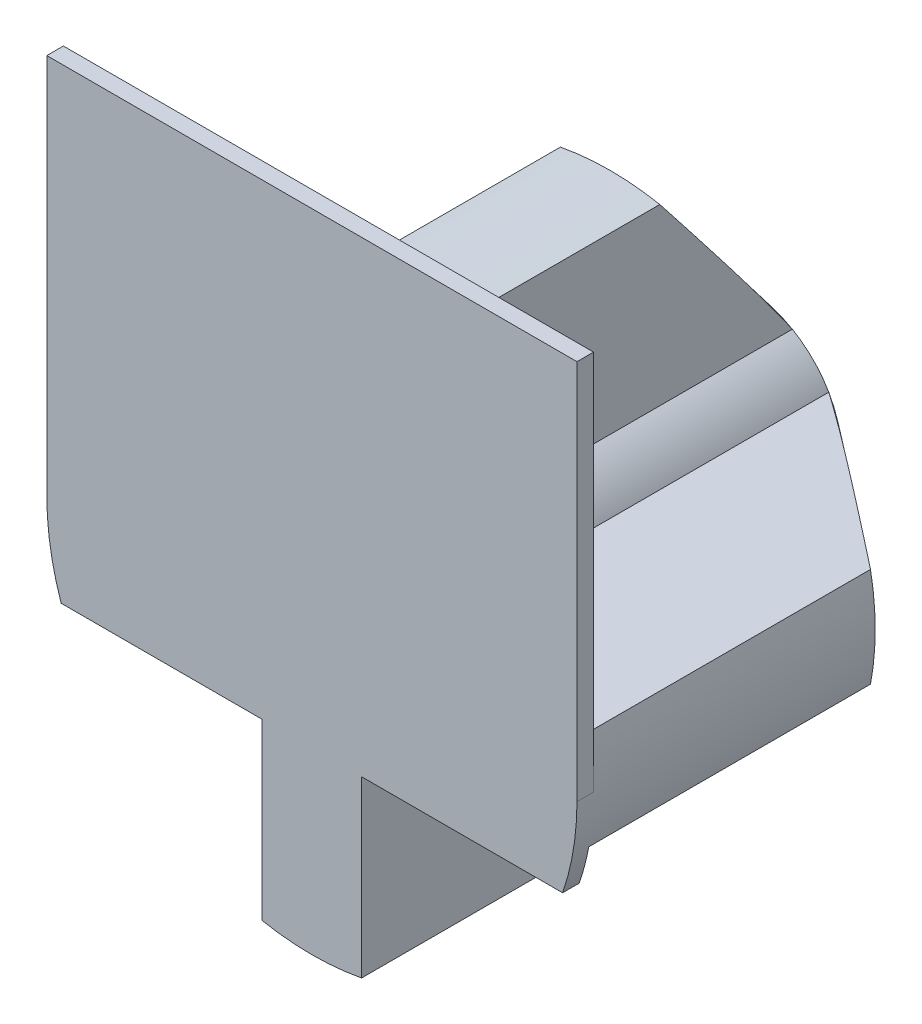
ISO-10303-21;
HEADER;
FILE_DESCRIPTION(('STEP AP214'),'2;1');
FILE_NAME('part.step','',(''),(''),'','','');
FILE_SCHEMA(('AUTOMOTIVE_DESIGN { 1 0 10303 214 1 1 1 1 }'));
ENDSEC;
DATA;
#1=APPLICATION_CONTEXT('core data for automotive mechanical design processes');
#2=APPLICATION_PROTOCOL_DEFINITION('international standard','automotive_design',2000,#1);
#3=PRODUCT_CONTEXT('',#1,'mechanical');
#4=PRODUCT('Part','Part','',(#3));
#5=PRODUCT_RELATED_PRODUCT_CATEGORY('part','',(#4));
#6=PRODUCT_DEFINITION_FORMATION('','',#4);
#7=PRODUCT_DEFINITION_CONTEXT('part definition',#1,'design');
#8=PRODUCT_DEFINITION('design','',#6,#7);
#9=PRODUCT_DEFINITION_SHAPE('','',#8);
#10=(LENGTH_UNIT() NAMED_UNIT(*) SI_UNIT(.MILLI.,.METRE.));
#11=(NAMED_UNIT(*) PLANE_ANGLE_UNIT() SI_UNIT($,.RADIAN.));
#12=(NAMED_UNIT(*) SI_UNIT($,.STERADIAN.) SOLID_ANGLE_UNIT());
#13=UNCERTAINTY_MEASURE_WITH_UNIT(LENGTH_MEASURE(1.E-05),#10,'distance_accuracy_value','');
#14=(GEOMETRIC_REPRESENTATION_CONTEXT(3) GLOBAL_UNCERTAINTY_ASSIGNED_CONTEXT((#13)) GLOBAL_UNIT_ASSIGNED_CONTEXT((#10,
#11,#12)) REPRESENTATION_CONTEXT('',''));
#15=CARTESIAN_POINT('',(0.,0.,0.));
#16=DIRECTION('',(0.,0.,1.));
#17=DIRECTION('',(1.,0.,0.));
#18=AXIS2_PLACEMENT_3D('',#15,#16,#17);
#19=CARTESIAN_POINT('',(-7.85811682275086,-1.5,13.));
#20=DIRECTION('',(0.,1.,0.));
#21=DIRECTION('',(0.,0.,1.));
#22=AXIS2_PLACEMENT_3D('',#19,#20,#21);
#23=PLANE('',#22);
#24=DIRECTION('',(1.,0.,0.));
#25=VECTOR('',#24,1.);
#26=CARTESIAN_POINT('',(-7.85811682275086,-1.5,12.5));
#27=LINE('',#26,#25);
#28=CARTESIAN_POINT('',(-7.85811682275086,-1.5,12.5));
#29=VERTEX_POINT('',#28);
#30=CARTESIAN_POINT('',(-2.59807621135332,-1.5,12.5));
#31=VERTEX_POINT('',#30);
#32=EDGE_CURVE('E364',#29,#31,#27,.T.);
#33=ORIENTED_EDGE('',*,*,#32,.F.);
#34=DIRECTION('',(0.,0.,-1.));
#35=VECTOR('',#34,1.);
#36=CARTESIAN_POINT('',(-7.85811682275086,-1.5,13.));
#37=LINE('',#36,#35);
#38=CARTESIAN_POINT('',(-7.85811682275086,-1.5,4.));
#39=VERTEX_POINT('',#38);
#40=EDGE_CURVE('E293',#29,#39,#37,.T.);
#41=ORIENTED_EDGE('',*,*,#40,.T.);
#42=CARTESIAN_POINT('',(-7.85881682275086,-1.5,4.00055006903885));
#43=CARTESIAN_POINT('',(-7.69346679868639,-1.5,3.87061787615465));
#44=CARTESIAN_POINT('',(-7.52804895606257,-1.5,3.74077190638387));
#45=CARTESIAN_POINT('',(-7.19704285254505,-1.5,3.48129656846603));
#46=CARTESIAN_POINT('',(-7.03145459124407,-1.5,3.35166720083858));
#47=CARTESIAN_POINT('',(-6.53434104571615,-1.5,2.96313822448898));
#48=CARTESIAN_POINT('',(-6.20250904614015,-1.5,2.70463081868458));
#49=CARTESIAN_POINT('',(-5.53988673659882,-1.5,2.1910213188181));
#50=CARTESIAN_POINT('',(-5.20910511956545,-1.5,1.93590803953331));
#51=CARTESIAN_POINT('',(-4.71136054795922,-1.5,1.55531750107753));
#52=CARTESIAN_POINT('',(-4.54518969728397,-1.5,1.42880508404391));
#53=CARTESIAN_POINT('',(-4.21212788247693,-1.5,1.1767327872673));
#54=CARTESIAN_POINT('',(-4.04523692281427,-1.5,1.05117290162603));
#55=CARTESIAN_POINT('',(-3.71634855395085,-1.5,0.805779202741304));
#56=CARTESIAN_POINT('',(-3.55438556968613,-1.5,0.685899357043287));
#57=CARTESIAN_POINT('',(-3.22912391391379,-1.5,0.447922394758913));
#58=CARTESIAN_POINT('',(-3.06582508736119,-1.5,0.3298254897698));
#59=CARTESIAN_POINT('',(-2.73637515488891,-1.5,0.0956828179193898));
#60=CARTESIAN_POINT('',(-2.57021322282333,-1.5,-0.0203478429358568));
#61=CARTESIAN_POINT('',(-2.31869451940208,-1.5,-0.191013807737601));
#62=CARTESIAN_POINT('',(-2.23448320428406,-1.5,-0.247334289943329));
#63=CARTESIAN_POINT('',(-2.06508101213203,-1.5,-0.358479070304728));
#64=CARTESIAN_POINT('',(-1.97989018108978,-1.5,-0.413303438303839));
#65=CARTESIAN_POINT('',(-1.80554828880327,-1.5,-0.522643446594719));
#66=CARTESIAN_POINT('',(-1.71635693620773,-1.5,-0.577095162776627));
#67=CARTESIAN_POINT('',(-1.5361930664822,-1.5,-0.683044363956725));
#68=CARTESIAN_POINT('',(-1.44522014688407,-1.5,-0.734541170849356));
#69=CARTESIAN_POINT('',(-1.26189012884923,-1.5,-0.832781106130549));
#70=CARTESIAN_POINT('',(-1.1695559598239,-1.5,-0.879566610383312));
#71=CARTESIAN_POINT('',(-0.981991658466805,-1.5,-0.967018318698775));
#72=CARTESIAN_POINT('',(-0.886762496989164,-1.5,-1.00768654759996));
#73=CARTESIAN_POINT('',(-0.727145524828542,-1.5,-1.06716989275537));
#74=CARTESIAN_POINT('',(-0.663752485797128,-1.5,-1.08862863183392));
#75=CARTESIAN_POINT('',(-0.535574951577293,-1.5,-1.12669203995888));
#76=CARTESIAN_POINT('',(-0.470792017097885,-1.5,-1.14330187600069));
#77=CARTESIAN_POINT('',(-0.338759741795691,-1.5,-1.17085040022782));
#78=CARTESIAN_POINT('',(-0.271486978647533,-1.5,-1.18168079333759));
#79=CARTESIAN_POINT('',(-0.169891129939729,-1.5,-1.19262884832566));
#80=CARTESIAN_POINT('',(-0.135841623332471,-1.5,-1.19539547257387));
#81=CARTESIAN_POINT('',(-0.0676304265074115,-1.5,-1.19909074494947));
#82=CARTESIAN_POINT('',(-0.0334686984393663,-1.5,-1.20001869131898));
#83=CARTESIAN_POINT('',(0.000699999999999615,-1.5,-1.19999986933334));
#84=B_SPLINE_CURVE_WITH_KNOTS('',3,(#42,#43,#44,#45,#46,#47,#48,#49,#50,#51,#52,#53,#54,#55,#56,
#57,#58,#59,#60,#61,#62,#63,#64,#65,#66,#67,#68,#69,#70,#71,#72,#73,#74,#75,#76,#77,#78,#79,#80,
#81,#82,#83),.UNSPECIFIED.,.F.,.F.,(4,2,2,2,2,2,2,2,2,2,2,2,2,2,2,2,2,2,2,2,4),(0.,
0.630878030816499,1.26175757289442,2.52367714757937,3.77686026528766,4.40340656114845,
5.02994897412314,5.63444684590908,6.23901590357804,6.84695550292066,7.15087151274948,
7.45477331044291,7.76823182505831,8.08176198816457,8.39215779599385,8.70245063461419,
8.90307929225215,9.10349337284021,9.30754152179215,9.40998205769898,9.51246168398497),.UNSPECIFIED.);
#85=CARTESIAN_POINT('',(-2.59807621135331,-1.5,0.));
#86=VERTEX_POINT('',#85);
#87=EDGE_CURVE('E571',#39,#86,#84,.T.);
#88=ORIENTED_EDGE('',*,*,#87,.T.);
#89=DIRECTION('',(0.,0.,-1.));
#90=VECTOR('',#89,1.);
#91=CARTESIAN_POINT('',(-2.59807621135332,-1.5,13.));
#92=LINE('',#91,#90);
#93=EDGE_CURVE('E596',#31,#86,#92,.T.);
#94=ORIENTED_EDGE('',*,*,#93,.F.);
#95=EDGE_LOOP('',(#33,#41,#88,#94));
#96=FACE_BOUND('',#95,.T.);
#97=ADVANCED_FACE('F37',(#96),#23,.F.);
#98=CARTESIAN_POINT('',(0.,0.,13.));
#99=DIRECTION('',(0.,0.,-1.));
#100=DIRECTION('',(-1.,0.,0.));
#101=AXIS2_PLACEMENT_3D('',#98,#99,#100);
#102=CYLINDRICAL_SURFACE('',#101,3.);
#103=CARTESIAN_POINT('',(0.,0.,12.5));
#104=DIRECTION('',(0.,0.,1.));
#105=DIRECTION('',(1.,0.,0.));
#106=AXIS2_PLACEMENT_3D('',#103,#104,#105);
#107=CIRCLE('',#106,3.);
#108=CARTESIAN_POINT('',(-1.5,-2.59807621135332,12.5));
#109=VERTEX_POINT('',#108);
#110=EDGE_CURVE('E307',#31,#109,#107,.T.);
#111=ORIENTED_EDGE('',*,*,#110,.F.);
#112=ORIENTED_EDGE('',*,*,#93,.T.);
#113=CARTESIAN_POINT('',(0.,0.,0.));
#114=DIRECTION('',(0.,0.,1.));
#115=DIRECTION('',(1.,0.,0.));
#116=AXIS2_PLACEMENT_3D('',#113,#114,#115);
#117=CIRCLE('',#116,3.);
#118=CARTESIAN_POINT('',(-1.5,-2.59807621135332,0.));
#119=VERTEX_POINT('',#118);
#120=EDGE_CURVE('E602',#86,#119,#117,.T.);
#121=ORIENTED_EDGE('',*,*,#120,.T.);
#122=DIRECTION('',(0.,0.,-1.));
#123=VECTOR('',#122,1.);
#124=CARTESIAN_POINT('',(-1.5,-2.59807621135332,13.));
#125=LINE('',#124,#123);
#126=EDGE_CURVE('E599',#109,#119,#125,.T.);
#127=ORIENTED_EDGE('',*,*,#126,.F.);
#128=EDGE_LOOP('',(#111,#112,#121,#127));
#129=FACE_BOUND('',#128,.T.);
#130=ADVANCED_FACE('F584',(#129),#102,.T.);
#131=CARTESIAN_POINT('',(0.,0.,13.));
#132=DIRECTION('',(0.,0.,-1.));
#133=DIRECTION('',(-1.,0.,0.));
#134=AXIS2_PLACEMENT_3D('',#131,#132,#133);
#135=CYLINDRICAL_SURFACE('',#134,3.);
#136=CARTESIAN_POINT('',(0.,0.,12.5));
#137=DIRECTION('',(0.,0.,1.));
#138=DIRECTION('',(1.,0.,0.));
#139=AXIS2_PLACEMENT_3D('',#136,#137,#138);
#140=CIRCLE('',#139,3.);
#141=CARTESIAN_POINT('',(1.5,-2.59807621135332,12.5));
#142=VERTEX_POINT('',#141);
#143=CARTESIAN_POINT('',(2.59807621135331,-1.5,12.5));
#144=VERTEX_POINT('',#143);
#145=EDGE_CURVE('E361',#142,#144,#140,.T.);
#146=ORIENTED_EDGE('',*,*,#145,.F.);
#147=DIRECTION('',(0.,0.,-1.));
#148=VECTOR('',#147,1.);
#149=CARTESIAN_POINT('',(1.5,-2.59807621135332,13.));
#150=LINE('',#149,#148);
#151=CARTESIAN_POINT('',(1.5,-2.59807621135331,0.));
#152=VERTEX_POINT('',#151);
#153=EDGE_CURVE('E667',#142,#152,#150,.T.);
#154=ORIENTED_EDGE('',*,*,#153,.T.);
#155=CARTESIAN_POINT('',(0.,0.,0.));
#156=DIRECTION('',(0.,0.,1.));
#157=DIRECTION('',(1.,0.,0.));
#158=AXIS2_PLACEMENT_3D('',#155,#156,#157);
#159=CIRCLE('',#158,3.);
#160=CARTESIAN_POINT('',(2.59807621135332,-1.5,0.));
#161=VERTEX_POINT('',#160);
#162=EDGE_CURVE('E644',#152,#161,#159,.T.);
#163=ORIENTED_EDGE('',*,*,#162,.T.);
#164=DIRECTION('',(0.,0.,-1.));
#165=VECTOR('',#164,1.);
#166=CARTESIAN_POINT('',(2.59807621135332,-1.5,13.));
#167=LINE('',#166,#165);
#168=EDGE_CURVE('E665',#144,#161,#167,.T.);
#169=ORIENTED_EDGE('',*,*,#168,.F.);
#170=EDGE_LOOP('',(#146,#154,#163,#169));
#171=FACE_BOUND('',#170,.T.);
#172=ADVANCED_FACE('F586',(#171),#135,.T.);
#173=CARTESIAN_POINT('',(7.85811682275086,-1.5,13.));
#174=DIRECTION('',(0.,1.,0.));
#175=DIRECTION('',(-1.,0.,0.));
#176=AXIS2_PLACEMENT_3D('',#173,#174,#175);
#177=PLANE('',#176);
#178=DIRECTION('',(1.,0.,0.));
#179=VECTOR('',#178,1.);
#180=CARTESIAN_POINT('',(7.85811682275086,-1.5,12.5));
#181=LINE('',#180,#179);
#182=CARTESIAN_POINT('',(7.85811682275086,-1.5,12.5));
#183=VERTEX_POINT('',#182);
#184=EDGE_CURVE('E359',#144,#183,#181,.T.);
#185=ORIENTED_EDGE('',*,*,#184,.F.);
#186=ORIENTED_EDGE('',*,*,#168,.T.);
#187=CARTESIAN_POINT('',(-0.000699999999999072,-1.5,-1.19999986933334));
#188=CARTESIAN_POINT('',(0.0558091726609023,-1.5,-1.2000746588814));
#189=CARTESIAN_POINT('',(0.112285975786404,-1.5,-1.19748815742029));
#190=CARTESIAN_POINT('',(0.224676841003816,-1.5,-1.18742013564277));
#191=CARTESIAN_POINT('',(0.280591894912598,-1.5,-1.17994982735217));
#192=CARTESIAN_POINT('',(0.39073958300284,-1.5,-1.16069275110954));
#193=CARTESIAN_POINT('',(0.44498483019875,-1.5,-1.14897657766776));
#194=CARTESIAN_POINT('',(0.552548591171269,-1.5,-1.12182460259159));
#195=CARTESIAN_POINT('',(0.605866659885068,-1.5,-1.1063870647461));
#196=CARTESIAN_POINT('',(0.731482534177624,-1.5,-1.06598570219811));
#197=CARTESIAN_POINT('',(0.803328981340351,-1.5,-1.03962746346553));
#198=CARTESIAN_POINT('',(0.945245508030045,-1.5,-0.982458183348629));
#199=CARTESIAN_POINT('',(1.01531439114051,-1.5,-0.951644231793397));
#200=CARTESIAN_POINT('',(1.15403638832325,-1.5,-0.88661759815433));
#201=CARTESIAN_POINT('',(1.22268591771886,-1.5,-0.852397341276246));
#202=CARTESIAN_POINT('',(1.35864833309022,-1.5,-0.781453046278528));
#203=CARTESIAN_POINT('',(1.42596151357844,-1.5,-0.744729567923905));
#204=CARTESIAN_POINT('',(1.56167816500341,-1.5,-0.668142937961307));
#205=CARTESIAN_POINT('',(1.63004572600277,-1.5,-0.628216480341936));
#206=CARTESIAN_POINT('',(1.76584245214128,-1.5,-0.546798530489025));
#207=CARTESIAN_POINT('',(1.83327157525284,-1.5,-0.505306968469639));
#208=CARTESIAN_POINT('',(1.96726309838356,-1.5,-0.421167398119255));
#209=CARTESIAN_POINT('',(2.03382663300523,-1.5,-0.378521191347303));
#210=CARTESIAN_POINT('',(2.16632235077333,-1.5,-0.292265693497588));
#211=CARTESIAN_POINT('',(2.2322545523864,-1.5,-0.248656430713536));
#212=CARTESIAN_POINT('',(2.42732816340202,-1.5,-0.117981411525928));
#213=CARTESIAN_POINT('',(2.55572679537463,-1.5,-0.0298075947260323));
#214=CARTESIAN_POINT('',(2.81112588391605,-1.5,0.148546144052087));
#215=CARTESIAN_POINT('',(2.93812625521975,-1.5,0.238726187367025));
#216=CARTESIAN_POINT('',(3.19112850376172,-1.5,0.420519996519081));
#217=CARTESIAN_POINT('',(3.31713020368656,-1.5,0.512134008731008));
#218=CARTESIAN_POINT('',(3.56837235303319,-1.5,0.696401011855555));
#219=CARTESIAN_POINT('',(3.69361279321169,-1.5,0.789054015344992));
#220=CARTESIAN_POINT('',(4.06877524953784,-1.5,1.06839241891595));
#221=CARTESIAN_POINT('',(4.31783396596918,-1.5,1.25623631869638));
#222=CARTESIAN_POINT('',(4.81451666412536,-1.5,1.63375002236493));
#223=CARTESIAN_POINT('',(5.06214079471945,-1.5,1.82341963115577));
#224=CARTESIAN_POINT('',(5.52291757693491,-1.5,2.17815744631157));
#225=CARTESIAN_POINT('',(5.73618870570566,-1.5,2.3430718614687));
#226=CARTESIAN_POINT('',(6.16222874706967,-1.5,2.67356178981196));
#227=CARTESIAN_POINT('',(6.37499764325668,-1.5,2.83913732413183));
#228=CARTESIAN_POINT('',(6.79977683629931,-1.5,3.1704786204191));
#229=CARTESIAN_POINT('',(7.01178780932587,-1.5,3.3362435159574));
#230=CARTESIAN_POINT('',(7.43550683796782,-1.5,3.66814407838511));
#231=CARTESIAN_POINT('',(7.64721490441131,-1.5,3.83427973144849));
#232=CARTESIAN_POINT('',(7.85881682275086,-1.5,4.00055006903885));
#233=B_SPLINE_CURVE_WITH_KNOTS('',3,(#187,#188,#189,#190,#191,#192,#193,#194,#195,#196,#197,
#198,#199,#200,#201,#202,#203,#204,#205,#206,#207,#208,#209,#210,#211,#212,#213,#214,#215,#216,
#217,#218,#219,#220,#221,#222,#223,#224,#225,#226,#227,#228,#229,#230,#231,#232),.UNSPECIFIED.,
.F.,.F.,(4,2,2,2,2,2,2,2,2,2,2,2,2,2,2,2,2,2,2,2,2,2,4),(0.,0.169414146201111,0.338440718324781,
0.504777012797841,0.671191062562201,0.900567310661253,1.1300940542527,1.36014312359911,
1.59014091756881,1.82763075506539,2.06513119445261,2.30228029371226,2.53942243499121,
3.00666610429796,3.47393810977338,3.94129129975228,4.40865015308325,5.34449616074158,
6.28024324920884,7.08902574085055,7.89783429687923,8.70519984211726,9.51253576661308),.UNSPECIFIED.);
#234=CARTESIAN_POINT('',(7.85811682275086,-1.5,4.));
#235=VERTEX_POINT('',#234);
#236=EDGE_CURVE('E550',#161,#235,#233,.T.);
#237=ORIENTED_EDGE('',*,*,#236,.T.);
#238=DIRECTION('',(0.,0.,-1.));
#239=VECTOR('',#238,1.);
#240=CARTESIAN_POINT('',(7.85811682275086,-1.5,13.));
#241=LINE('',#240,#239);
#242=EDGE_CURVE('E663',#183,#235,#241,.T.);
#243=ORIENTED_EDGE('',*,*,#242,.F.);
#244=EDGE_LOOP('',(#185,#186,#237,#243));
#245=FACE_BOUND('',#244,.T.);
#246=ADVANCED_FACE('F727',(#245),#177,.F.);
#247=CARTESIAN_POINT('',(0.,0.,13.));
#248=DIRECTION('',(0.,0.,-1.));
#249=DIRECTION('',(-1.,0.,0.));
#250=AXIS2_PLACEMENT_3D('',#247,#248,#249);
#251=CYLINDRICAL_SURFACE('',#250,8.);
#252=CARTESIAN_POINT('',(0.,0.,12.5));
#253=DIRECTION('',(0.,0.,1.));
#254=DIRECTION('',(1.,0.,0.));
#255=AXIS2_PLACEMENT_3D('',#252,#253,#254);
#256=CIRCLE('',#255,8.);
#257=CARTESIAN_POINT('',(8.,0.,12.5));
#258=VERTEX_POINT('',#257);
#259=CARTESIAN_POINT('',(7.85811682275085,1.50000000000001,12.5));
#260=VERTEX_POINT('',#259);
#261=EDGE_CURVE('E355',#258,#260,#256,.T.);
#262=ORIENTED_EDGE('',*,*,#261,.F.);
#263=DIRECTION('',(0.,0.,1.));
#264=VECTOR('',#263,1.);
#265=CARTESIAN_POINT('',(8.,0.,12.5));
#266=LINE('',#265,#264);
#267=CARTESIAN_POINT('',(8.,0.,13.));
#268=VERTEX_POINT('',#267);
#269=EDGE_CURVE('E339',#258,#268,#266,.T.);
#270=ORIENTED_EDGE('',*,*,#269,.T.);
#271=CARTESIAN_POINT('',(0.,0.,13.));
#272=DIRECTION('',(0.,0.,1.));
#273=DIRECTION('',(1.,0.,0.));
#274=AXIS2_PLACEMENT_3D('',#271,#272,#273);
#275=CIRCLE('',#274,8.);
#276=CARTESIAN_POINT('',(7.56637297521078,-2.59807621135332,13.));
#277=VERTEX_POINT('',#276);
#278=EDGE_CURVE('E650',#277,#268,#275,.T.);
#279=ORIENTED_EDGE('',*,*,#278,.F.);
#280=DIRECTION('',(0.,0.,1.));
#281=VECTOR('',#280,1.);
#282=CARTESIAN_POINT('',(7.56637297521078,-2.59807621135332,12.5));
#283=LINE('',#282,#281);
#284=CARTESIAN_POINT('',(7.56637297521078,-2.59807621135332,12.5));
#285=VERTEX_POINT('',#284);
#286=EDGE_CURVE('E302',#285,#277,#283,.T.);
#287=ORIENTED_EDGE('',*,*,#286,.F.);
#288=CARTESIAN_POINT('',(0.,0.,12.5));
#289=DIRECTION('',(0.,0.,1.));
#290=DIRECTION('',(1.,0.,0.));
#291=AXIS2_PLACEMENT_3D('',#288,#289,#290);
#292=CIRCLE('',#291,8.);
#293=EDGE_CURVE('E309',#285,#183,#292,.T.);
#294=ORIENTED_EDGE('',*,*,#293,.T.);
#295=ORIENTED_EDGE('',*,*,#242,.T.);
#296=CARTESIAN_POINT('',(0.,0.,4.));
#297=DIRECTION('',(0.,0.,-1.));
#298=DIRECTION('',(-1.,0.,0.));
#299=AXIS2_PLACEMENT_3D('',#296,#297,#298);
#300=CIRCLE('',#299,8.);
#301=CARTESIAN_POINT('',(7.85811682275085,1.50000000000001,4.));
#302=VERTEX_POINT('',#301);
#303=EDGE_CURVE('E681',#302,#235,#300,.T.);
#304=ORIENTED_EDGE('',*,*,#303,.F.);
#305=DIRECTION('',(0.,0.,-1.));
#306=VECTOR('',#305,1.);
#307=CARTESIAN_POINT('',(7.85811682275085,1.50000000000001,13.));
#308=LINE('',#307,#306);
#309=EDGE_CURVE('E661',#260,#302,#308,.T.);
#310=ORIENTED_EDGE('',*,*,#309,.F.);
#311=EDGE_LOOP('',(#262,#270,#279,#287,#294,#295,#304,#310));
#312=FACE_BOUND('',#311,.T.);
#313=ADVANCED_FACE('F721',(#312),#251,.T.);
#314=CARTESIAN_POINT('',(7.85811682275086,1.50000000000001,13.));
#315=DIRECTION('',(0.,-1.,0.));
#316=DIRECTION('',(1.,0.,0.));
#317=AXIS2_PLACEMENT_3D('',#314,#315,#316);
#318=PLANE('',#317);
#319=DIRECTION('',(-1.,0.,0.));
#320=VECTOR('',#319,1.);
#321=CARTESIAN_POINT('',(7.85811682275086,1.50000000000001,12.5));
#322=LINE('',#321,#320);
#323=CARTESIAN_POINT('',(2.59807621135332,1.5,12.5));
#324=VERTEX_POINT('',#323);
#325=EDGE_CURVE('E353',#260,#324,#322,.T.);
#326=ORIENTED_EDGE('',*,*,#325,.F.);
#327=ORIENTED_EDGE('',*,*,#309,.T.);
#328=CARTESIAN_POINT('',(7.85881682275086,1.50000000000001,4.00055006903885));
#329=CARTESIAN_POINT('',(7.69346679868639,1.50000000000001,3.87061787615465));
#330=CARTESIAN_POINT('',(7.52804895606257,1.50000000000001,3.74077190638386));
#331=CARTESIAN_POINT('',(7.19704285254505,1.50000000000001,3.48129656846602));
#332=CARTESIAN_POINT('',(7.03145459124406,1.50000000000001,3.35166720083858));
#333=CARTESIAN_POINT('',(6.53434104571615,1.5,2.96313822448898));
#334=CARTESIAN_POINT('',(6.20250904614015,1.5,2.70463081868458));
#335=CARTESIAN_POINT('',(5.53988673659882,1.5,2.1910213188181));
#336=CARTESIAN_POINT('',(5.20910511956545,1.5,1.93590803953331));
#337=CARTESIAN_POINT('',(4.71136054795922,1.5,1.55531750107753));
#338=CARTESIAN_POINT('',(4.54518969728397,1.5,1.42880508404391));
#339=CARTESIAN_POINT('',(4.21212788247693,1.5,1.1767327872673));
#340=CARTESIAN_POINT('',(4.04523692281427,1.5,1.05117290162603));
#341=CARTESIAN_POINT('',(3.71634855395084,1.5,0.805779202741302));
#342=CARTESIAN_POINT('',(3.55438556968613,1.5,0.685899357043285));
#343=CARTESIAN_POINT('',(3.22912391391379,1.5,0.447922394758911));
#344=CARTESIAN_POINT('',(3.06582508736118,1.5,0.329825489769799));
#345=CARTESIAN_POINT('',(2.73637515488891,1.5,0.0956828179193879));
#346=CARTESIAN_POINT('',(2.57021322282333,1.5,-0.0203478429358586));
#347=CARTESIAN_POINT('',(2.31869451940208,1.5,-0.191013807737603));
#348=CARTESIAN_POINT('',(2.23448320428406,1.5,-0.24733428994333));
#349=CARTESIAN_POINT('',(2.06508101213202,1.5,-0.358479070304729));
#350=CARTESIAN_POINT('',(1.97989018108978,1.5,-0.413303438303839));
#351=CARTESIAN_POINT('',(1.80554828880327,1.5,-0.52264344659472));
#352=CARTESIAN_POINT('',(1.71635693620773,1.5,-0.577095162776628));
#353=CARTESIAN_POINT('',(1.5361930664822,1.5,-0.683044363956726));
#354=CARTESIAN_POINT('',(1.44522014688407,1.5,-0.734541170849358));
#355=CARTESIAN_POINT('',(1.26189012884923,1.5,-0.832781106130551));
#356=CARTESIAN_POINT('',(1.1695559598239,1.5,-0.879566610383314));
#357=CARTESIAN_POINT('',(0.981991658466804,1.5,-0.967018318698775));
#358=CARTESIAN_POINT('',(0.886762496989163,1.5,-1.00768654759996));
#359=CARTESIAN_POINT('',(0.727145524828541,1.5,-1.06716989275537));
#360=CARTESIAN_POINT('',(0.663752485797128,1.5,-1.08862863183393));
#361=CARTESIAN_POINT('',(0.535574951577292,1.5,-1.12669203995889));
#362=CARTESIAN_POINT('',(0.470792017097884,1.5,-1.14330187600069));
#363=CARTESIAN_POINT('',(0.338759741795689,1.5,-1.17085040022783));
#364=CARTESIAN_POINT('',(0.271486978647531,1.5,-1.18168079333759));
#365=CARTESIAN_POINT('',(0.169891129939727,1.5,-1.19262884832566));
#366=CARTESIAN_POINT('',(0.135841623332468,1.5,-1.19539547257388));
#367=CARTESIAN_POINT('',(0.0676304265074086,1.5,-1.19909074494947));
#368=CARTESIAN_POINT('',(0.033468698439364,1.5,-1.20001869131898));
#369=CARTESIAN_POINT('',(-0.000700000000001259,1.5,-1.19999986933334));
#370=B_SPLINE_CURVE_WITH_KNOTS('',3,(#328,#329,#330,#331,#332,#333,#334,#335,#336,#337,#338,
#339,#340,#341,#342,#343,#344,#345,#346,#347,#348,#349,#350,#351,#352,#353,#354,#355,#356,#357,
#358,#359,#360,#361,#362,#363,#364,#365,#366,#367,#368,#369),.UNSPECIFIED.,.F.,.F.,(4,2,2,2,2,2,
2,2,2,2,2,2,2,2,2,2,2,2,2,2,4),(0.,0.630878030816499,1.26175757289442,2.52367714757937,
3.77686026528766,4.40340656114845,5.02994897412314,5.63444684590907,6.23901590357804,
6.84695550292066,7.15087151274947,7.45477331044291,7.76823182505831,8.08176198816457,
8.39215779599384,8.70245063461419,8.90307929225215,9.10349337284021,9.30754152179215,
9.40998205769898,9.51246168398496),.UNSPECIFIED.);
#371=CARTESIAN_POINT('',(2.59807621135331,1.5,0.));
#372=VERTEX_POINT('',#371);
#373=EDGE_CURVE('E542',#302,#372,#370,.T.);
#374=ORIENTED_EDGE('',*,*,#373,.T.);
#375=DIRECTION('',(0.,0.,-1.));
#376=VECTOR('',#375,1.);
#377=CARTESIAN_POINT('',(2.59807621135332,1.5,13.));
#378=LINE('',#377,#376);
#379=EDGE_CURVE('E659',#324,#372,#378,.T.);
#380=ORIENTED_EDGE('',*,*,#379,.F.);
#381=EDGE_LOOP('',(#326,#327,#374,#380));
#382=FACE_BOUND('',#381,.T.);
#383=ADVANCED_FACE('F717',(#382),#318,.F.);
#384=CARTESIAN_POINT('',(0.,0.,13.));
#385=DIRECTION('',(0.,0.,-1.));
#386=DIRECTION('',(-1.,0.,0.));
#387=AXIS2_PLACEMENT_3D('',#384,#385,#386);
#388=CYLINDRICAL_SURFACE('',#387,3.);
#389=CARTESIAN_POINT('',(0.,0.,12.5));
#390=DIRECTION('',(0.,0.,1.));
#391=DIRECTION('',(1.,0.,0.));
#392=AXIS2_PLACEMENT_3D('',#389,#390,#391);
#393=CIRCLE('',#392,3.);
#394=CARTESIAN_POINT('',(1.5,2.59807621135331,12.5));
#395=VERTEX_POINT('',#394);
#396=EDGE_CURVE('E351',#324,#395,#393,.T.);
#397=ORIENTED_EDGE('',*,*,#396,.F.);
#398=ORIENTED_EDGE('',*,*,#379,.T.);
#399=CARTESIAN_POINT('',(0.,0.,0.));
#400=DIRECTION('',(0.,0.,1.));
#401=DIRECTION('',(1.,0.,0.));
#402=AXIS2_PLACEMENT_3D('',#399,#400,#401);
#403=CIRCLE('',#402,3.);
#404=CARTESIAN_POINT('',(1.5,2.59807621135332,0.));
#405=VERTEX_POINT('',#404);
#406=EDGE_CURVE('E641',#372,#405,#403,.T.);
#407=ORIENTED_EDGE('',*,*,#406,.T.);
#408=DIRECTION('',(0.,0.,-1.));
#409=VECTOR('',#408,1.);
#410=CARTESIAN_POINT('',(1.5,2.59807621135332,13.));
#411=LINE('',#410,#409);
#412=EDGE_CURVE('E657',#395,#405,#411,.T.);
#413=ORIENTED_EDGE('',*,*,#412,.F.);
#414=EDGE_LOOP('',(#397,#398,#407,#413));
#415=FACE_BOUND('',#414,.T.);
#416=ADVANCED_FACE('F712',(#415),#388,.T.);
#417=CARTESIAN_POINT('',(1.5,7.85811682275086,13.));
#418=DIRECTION('',(-1.,0.,0.));
#419=DIRECTION('',(0.,-1.,0.));
#420=AXIS2_PLACEMENT_3D('',#417,#418,#419);
#421=PLANE('',#420);
#422=DIRECTION('',(0.,1.,0.));
#423=VECTOR('',#422,1.);
#424=CARTESIAN_POINT('',(1.5,7.85811682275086,12.5));
#425=LINE('',#424,#423);
#426=CARTESIAN_POINT('',(1.5,7.85811682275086,12.5));
#427=VERTEX_POINT('',#426);
#428=EDGE_CURVE('E349',#395,#427,#425,.T.);
#429=ORIENTED_EDGE('',*,*,#428,.F.);
#430=ORIENTED_EDGE('',*,*,#412,.T.);
#431=CARTESIAN_POINT('',(1.5,-0.000699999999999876,-1.19999986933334));
#432=CARTESIAN_POINT('',(1.5,0.0558091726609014,-1.2000746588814));
#433=CARTESIAN_POINT('',(1.5,0.112285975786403,-1.19748815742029));
#434=CARTESIAN_POINT('',(1.5,0.224676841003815,-1.18742013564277));
#435=CARTESIAN_POINT('',(1.5,0.280591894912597,-1.17994982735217));
#436=CARTESIAN_POINT('',(1.5,0.390739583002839,-1.16069275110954));
#437=CARTESIAN_POINT('',(1.5,0.444984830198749,-1.14897657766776));
#438=CARTESIAN_POINT('',(1.5,0.552548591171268,-1.12182460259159));
#439=CARTESIAN_POINT('',(1.5,0.605866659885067,-1.1063870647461));
#440=CARTESIAN_POINT('',(1.5,0.731482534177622,-1.06598570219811));
#441=CARTESIAN_POINT('',(1.5,0.803328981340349,-1.03962746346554));
#442=CARTESIAN_POINT('',(1.5,0.945245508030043,-0.982458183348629));
#443=CARTESIAN_POINT('',(1.5,1.01531439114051,-0.951644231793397));
#444=CARTESIAN_POINT('',(1.5,1.15403638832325,-0.886617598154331));
#445=CARTESIAN_POINT('',(1.5,1.22268591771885,-0.852397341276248));
#446=CARTESIAN_POINT('',(1.5,1.35864833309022,-0.78145304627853));
#447=CARTESIAN_POINT('',(1.5,1.42596151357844,-0.744729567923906));
#448=CARTESIAN_POINT('',(1.5,1.5616781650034,-0.668142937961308));
#449=CARTESIAN_POINT('',(1.5,1.63004572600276,-0.628216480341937));
#450=CARTESIAN_POINT('',(1.5,1.76584245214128,-0.546798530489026));
#451=CARTESIAN_POINT('',(1.5,1.83327157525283,-0.50530696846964));
#452=CARTESIAN_POINT('',(1.5,1.96726309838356,-0.421167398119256));
#453=CARTESIAN_POINT('',(1.5,2.03382663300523,-0.378521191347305));
#454=CARTESIAN_POINT('',(1.5,2.16632235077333,-0.29226569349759));
#455=CARTESIAN_POINT('',(1.5,2.23225455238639,-0.248656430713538));
#456=CARTESIAN_POINT('',(1.5,2.42732816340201,-0.117981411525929));
#457=CARTESIAN_POINT('',(1.5,2.55572679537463,-0.0298075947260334));
#458=CARTESIAN_POINT('',(1.5,2.81112588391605,0.148546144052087));
#459=CARTESIAN_POINT('',(1.5,2.93812625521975,0.238726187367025));
#460=CARTESIAN_POINT('',(1.5,3.19112850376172,0.420519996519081));
#461=CARTESIAN_POINT('',(1.5,3.31713020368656,0.512134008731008));
#462=CARTESIAN_POINT('',(1.5,3.56837235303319,0.696401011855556));
#463=CARTESIAN_POINT('',(1.5,3.69361279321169,0.789054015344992));
#464=CARTESIAN_POINT('',(1.5,4.06877524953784,1.06839241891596));
#465=CARTESIAN_POINT('',(1.5,4.31783396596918,1.25623631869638));
#466=CARTESIAN_POINT('',(1.5,4.81451666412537,1.63375002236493));
#467=CARTESIAN_POINT('',(1.5,5.06214079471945,1.82341963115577));
#468=CARTESIAN_POINT('',(1.5,5.52291757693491,2.17815744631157));
#469=CARTESIAN_POINT('',(1.5,5.73618870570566,2.3430718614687));
#470=CARTESIAN_POINT('',(1.5,6.16222874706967,2.67356178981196));
#471=CARTESIAN_POINT('',(1.5,6.37499764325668,2.83913732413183));
#472=CARTESIAN_POINT('',(1.5,6.79977683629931,3.1704786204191));
#473=CARTESIAN_POINT('',(1.5,7.01178780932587,3.3362435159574));
#474=CARTESIAN_POINT('',(1.5,7.43550683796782,3.66814407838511));
#475=CARTESIAN_POINT('',(1.5,7.64721490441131,3.83427973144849));
#476=CARTESIAN_POINT('',(1.5,7.85881682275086,4.00055006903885));
#477=B_SPLINE_CURVE_WITH_KNOTS('',3,(#431,#432,#433,#434,#435,#436,#437,#438,#439,#440,#441,
#442,#443,#444,#445,#446,#447,#448,#449,#450,#451,#452,#453,#454,#455,#456,#457,#458,#459,#460,
#461,#462,#463,#464,#465,#466,#467,#468,#469,#470,#471,#472,#473,#474,#475,#476),.UNSPECIFIED.,
.F.,.F.,(4,2,2,2,2,2,2,2,2,2,2,2,2,2,2,2,2,2,2,2,2,2,4),(0.,0.169414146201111,0.338440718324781,
0.50477701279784,0.6711910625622,0.900567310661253,1.1300940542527,1.36014312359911,
1.59014091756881,1.82763075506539,2.06513119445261,2.30228029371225,2.53942243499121,
3.00666610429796,3.47393810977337,3.94129129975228,4.40865015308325,5.34449616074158,
6.28024324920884,7.08902574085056,7.89783429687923,8.70519984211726,9.51253576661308),.UNSPECIFIED.);
#478=CARTESIAN_POINT('',(1.5,7.85811682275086,4.));
#479=VERTEX_POINT('',#478);
#480=EDGE_CURVE('E534',#405,#479,#477,.T.);
#481=ORIENTED_EDGE('',*,*,#480,.T.);
#482=DIRECTION('',(0.,0.,-1.));
#483=VECTOR('',#482,1.);
#484=CARTESIAN_POINT('',(1.5,7.85811682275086,13.));
#485=LINE('',#484,#483);
#486=EDGE_CURVE('E655',#427,#479,#485,.T.);
#487=ORIENTED_EDGE('',*,*,#486,.F.);
#488=EDGE_LOOP('',(#429,#430,#481,#487));
#489=FACE_BOUND('',#488,.T.);
#490=ADVANCED_FACE('F700',(#489),#421,.F.);
#491=CARTESIAN_POINT('',(0.,0.,13.));
#492=DIRECTION('',(0.,0.,-1.));
#493=DIRECTION('',(-1.,0.,0.));
#494=AXIS2_PLACEMENT_3D('',#491,#492,#493);
#495=CYLINDRICAL_SURFACE('',#494,8.);
#496=CARTESIAN_POINT('',(0.,0.,12.5));
#497=DIRECTION('',(0.,0.,1.));
#498=DIRECTION('',(1.,0.,0.));
#499=AXIS2_PLACEMENT_3D('',#496,#497,#498);
#500=CIRCLE('',#499,8.);
#501=CARTESIAN_POINT('',(-1.5,7.85811682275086,12.5));
#502=VERTEX_POINT('',#501);
#503=EDGE_CURVE('E347',#427,#502,#500,.T.);
#504=ORIENTED_EDGE('',*,*,#503,.F.);
#505=ORIENTED_EDGE('',*,*,#486,.T.);
#506=CARTESIAN_POINT('',(-1.5,7.85811682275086,4.));
#507=VERTEX_POINT('',#506);
#508=EDGE_CURVE('E496',#507,#479,#300,.T.);
#509=ORIENTED_EDGE('',*,*,#508,.F.);
#510=DIRECTION('',(0.,0.,-1.));
#511=VECTOR('',#510,1.);
#512=CARTESIAN_POINT('',(-1.5,7.85811682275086,13.));
#513=LINE('',#512,#511);
#514=EDGE_CURVE('E653',#502,#507,#513,.T.);
#515=ORIENTED_EDGE('',*,*,#514,.F.);
#516=EDGE_LOOP('',(#504,#505,#509,#515));
#517=FACE_BOUND('',#516,.T.);
#518=ADVANCED_FACE('F707',(#517),#495,.T.);
#519=CARTESIAN_POINT('',(-1.5,7.85811682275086,13.));
#520=DIRECTION('',(1.,0.,0.));
#521=DIRECTION('',(0.,1.,0.));
#522=AXIS2_PLACEMENT_3D('',#519,#520,#521);
#523=PLANE('',#522);
#524=DIRECTION('',(0.,-1.,0.));
#525=VECTOR('',#524,1.);
#526=CARTESIAN_POINT('',(-1.5,7.85811682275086,12.5));
#527=LINE('',#526,#525);
#528=CARTESIAN_POINT('',(-1.5,2.59807621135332,12.5));
#529=VERTEX_POINT('',#528);
#530=EDGE_CURVE('E345',#502,#529,#527,.T.);
#531=ORIENTED_EDGE('',*,*,#530,.F.);
#532=ORIENTED_EDGE('',*,*,#514,.T.);
#533=CARTESIAN_POINT('',(-1.5,7.85881682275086,4.00055006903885));
#534=CARTESIAN_POINT('',(-1.5,7.69346679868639,3.87061787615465));
#535=CARTESIAN_POINT('',(-1.5,7.52804895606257,3.74077190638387));
#536=CARTESIAN_POINT('',(-1.5,7.19704285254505,3.48129656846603));
#537=CARTESIAN_POINT('',(-1.5,7.03145459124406,3.35166720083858));
#538=CARTESIAN_POINT('',(-1.5,6.53434104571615,2.96313822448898));
#539=CARTESIAN_POINT('',(-1.5,6.20250904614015,2.70463081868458));
#540=CARTESIAN_POINT('',(-1.5,5.53988673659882,2.1910213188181));
#541=CARTESIAN_POINT('',(-1.5,5.20910511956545,1.93590803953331));
#542=CARTESIAN_POINT('',(-1.5,4.71136054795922,1.55531750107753));
#543=CARTESIAN_POINT('',(-1.5,4.54518969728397,1.42880508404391));
#544=CARTESIAN_POINT('',(-1.5,4.21212788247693,1.1767327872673));
#545=CARTESIAN_POINT('',(-1.5,4.04523692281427,1.05117290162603));
#546=CARTESIAN_POINT('',(-1.5,3.71634855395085,0.805779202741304));
#547=CARTESIAN_POINT('',(-1.5,3.55438556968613,0.685899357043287));
#548=CARTESIAN_POINT('',(-1.5,3.22912391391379,0.447922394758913));
#549=CARTESIAN_POINT('',(-1.5,3.06582508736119,0.329825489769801));
#550=CARTESIAN_POINT('',(-1.5,2.73637515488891,0.0956828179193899));
#551=CARTESIAN_POINT('',(-1.5,2.57021322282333,-0.0203478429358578));
#552=CARTESIAN_POINT('',(-1.5,2.31869451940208,-0.191013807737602));
#553=CARTESIAN_POINT('',(-1.5,2.23448320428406,-0.247334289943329));
#554=CARTESIAN_POINT('',(-1.5,2.06508101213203,-0.358479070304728));
#555=CARTESIAN_POINT('',(-1.5,1.97989018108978,-0.413303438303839));
#556=CARTESIAN_POINT('',(-1.5,1.80554828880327,-0.522643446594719));
#557=CARTESIAN_POINT('',(-1.5,1.71635693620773,-0.577095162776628));
#558=CARTESIAN_POINT('',(-1.5,1.5361930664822,-0.683044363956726));
#559=CARTESIAN_POINT('',(-1.5,1.44522014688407,-0.734541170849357));
#560=CARTESIAN_POINT('',(-1.5,1.26189012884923,-0.83278110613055));
#561=CARTESIAN_POINT('',(-1.5,1.1695559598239,-0.879566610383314));
#562=CARTESIAN_POINT('',(-1.5,0.981991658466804,-0.967018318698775));
#563=CARTESIAN_POINT('',(-1.5,0.886762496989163,-1.00768654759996));
#564=CARTESIAN_POINT('',(-1.5,0.727145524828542,-1.06716989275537));
#565=CARTESIAN_POINT('',(-1.5,0.663752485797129,-1.08862863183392));
#566=CARTESIAN_POINT('',(-1.5,0.535574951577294,-1.12669203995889));
#567=CARTESIAN_POINT('',(-1.5,0.470792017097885,-1.14330187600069));
#568=CARTESIAN_POINT('',(-1.5,0.33875974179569,-1.17085040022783));
#569=CARTESIAN_POINT('',(-1.5,0.271486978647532,-1.18168079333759));
#570=CARTESIAN_POINT('',(-1.5,0.169891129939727,-1.19262884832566));
#571=CARTESIAN_POINT('',(-1.5,0.135841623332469,-1.19539547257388));
#572=CARTESIAN_POINT('',(-1.5,0.0676304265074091,-1.19909074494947));
#573=CARTESIAN_POINT('',(-1.5,0.0334686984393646,-1.20001869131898));
#574=CARTESIAN_POINT('',(-1.5,-0.000700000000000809,-1.19999986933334));
#575=B_SPLINE_CURVE_WITH_KNOTS('',3,(#533,#534,#535,#536,#537,#538,#539,#540,#541,#542,#543,
#544,#545,#546,#547,#548,#549,#550,#551,#552,#553,#554,#555,#556,#557,#558,#559,#560,#561,#562,
#563,#564,#565,#566,#567,#568,#569,#570,#571,#572,#573,#574),.UNSPECIFIED.,.F.,.F.,(4,2,2,2,2,2,
2,2,2,2,2,2,2,2,2,2,2,2,2,2,4),(0.,0.630878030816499,1.26175757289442,2.52367714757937,
3.77686026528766,4.40340656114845,5.02994897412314,5.63444684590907,6.23901590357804,
6.84695550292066,7.15087151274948,7.45477331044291,7.76823182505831,8.08176198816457,
8.39215779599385,8.70245063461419,8.90307929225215,9.10349337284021,9.30754152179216,
9.40998205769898,9.51246168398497),.UNSPECIFIED.);
#576=CARTESIAN_POINT('',(-1.5,2.59807621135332,0.));
#577=VERTEX_POINT('',#576);
#578=EDGE_CURVE('E506',#507,#577,#575,.T.);
#579=ORIENTED_EDGE('',*,*,#578,.T.);
#580=DIRECTION('',(0.,0.,-1.));
#581=VECTOR('',#580,1.);
#582=CARTESIAN_POINT('',(-1.5,2.59807621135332,13.));
#583=LINE('',#582,#581);
#584=EDGE_CURVE('E638',#529,#577,#583,.T.);
#585=ORIENTED_EDGE('',*,*,#584,.F.);
#586=EDGE_LOOP('',(#531,#532,#579,#585));
#587=FACE_BOUND('',#586,.T.);
#588=ADVANCED_FACE('F705',(#587),#523,.F.);
#589=CARTESIAN_POINT('',(0.,0.,13.));
#590=DIRECTION('',(0.,0.,-1.));
#591=DIRECTION('',(-1.,0.,0.));
#592=AXIS2_PLACEMENT_3D('',#589,#590,#591);
#593=CYLINDRICAL_SURFACE('',#592,3.);
#594=CARTESIAN_POINT('',(0.,0.,12.5));
#595=DIRECTION('',(0.,0.,1.));
#596=DIRECTION('',(1.,0.,0.));
#597=AXIS2_PLACEMENT_3D('',#594,#595,#596);
#598=CIRCLE('',#597,3.);
#599=CARTESIAN_POINT('',(-2.59807621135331,1.5,12.5));
#600=VERTEX_POINT('',#599);
#601=EDGE_CURVE('E334',#529,#600,#598,.T.);
#602=ORIENTED_EDGE('',*,*,#601,.F.);
#603=ORIENTED_EDGE('',*,*,#584,.T.);
#604=CARTESIAN_POINT('',(0.,0.,0.));
#605=DIRECTION('',(0.,0.,1.));
#606=DIRECTION('',(1.,0.,0.));
#607=AXIS2_PLACEMENT_3D('',#604,#605,#606);
#608=CIRCLE('',#607,3.);
#609=CARTESIAN_POINT('',(-2.59807621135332,1.5,0.));
#610=VERTEX_POINT('',#609);
#611=EDGE_CURVE('E630',#577,#610,#608,.T.);
#612=ORIENTED_EDGE('',*,*,#611,.T.);
#613=DIRECTION('',(0.,0.,-1.));
#614=VECTOR('',#613,1.);
#615=CARTESIAN_POINT('',(-2.59807621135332,1.5,13.));
#616=LINE('',#615,#614);
#617=EDGE_CURVE('E636',#600,#610,#616,.T.);
#618=ORIENTED_EDGE('',*,*,#617,.F.);
#619=EDGE_LOOP('',(#602,#603,#612,#618));
#620=FACE_BOUND('',#619,.T.);
#621=ADVANCED_FACE('F635',(#620),#593,.T.);
#622=CARTESIAN_POINT('',(-7.85811682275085,1.5,13.));
#623=DIRECTION('',(0.,-1.,0.));
#624=DIRECTION('',(1.,0.,0.));
#625=AXIS2_PLACEMENT_3D('',#622,#623,#624);
#626=PLANE('',#625);
#627=DIRECTION('',(-1.,0.,0.));
#628=VECTOR('',#627,1.);
#629=CARTESIAN_POINT('',(-7.85811682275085,1.5,12.5));
#630=LINE('',#629,#628);
#631=CARTESIAN_POINT('',(-7.85811682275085,1.5,12.5));
#632=VERTEX_POINT('',#631);
#633=EDGE_CURVE('E11',#600,#632,#630,.T.);
#634=ORIENTED_EDGE('',*,*,#633,.F.);
#635=ORIENTED_EDGE('',*,*,#617,.T.);
#636=CARTESIAN_POINT('',(0.000700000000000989,1.5,-1.19999986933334));
#637=CARTESIAN_POINT('',(-0.0558091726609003,1.5,-1.2000746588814));
#638=CARTESIAN_POINT('',(-0.112285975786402,1.5,-1.19748815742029));
#639=CARTESIAN_POINT('',(-0.224676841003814,1.5,-1.18742013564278));
#640=CARTESIAN_POINT('',(-0.280591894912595,1.5,-1.17994982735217));
#641=CARTESIAN_POINT('',(-0.390739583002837,1.5,-1.16069275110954));
#642=CARTESIAN_POINT('',(-0.444984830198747,1.5,-1.14897657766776));
#643=CARTESIAN_POINT('',(-0.552548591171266,1.5,-1.1218246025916));
#644=CARTESIAN_POINT('',(-0.605866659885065,1.5,-1.1063870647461));
#645=CARTESIAN_POINT('',(-0.73148253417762,1.5,-1.06598570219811));
#646=CARTESIAN_POINT('',(-0.803328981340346,1.5,-1.03962746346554));
#647=CARTESIAN_POINT('',(-0.94524550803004,1.5,-0.982458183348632));
#648=CARTESIAN_POINT('',(-1.0153143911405,1.5,-0.9516442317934));
#649=CARTESIAN_POINT('',(-1.15403638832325,1.5,-0.886617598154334));
#650=CARTESIAN_POINT('',(-1.22268591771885,1.5,-0.852397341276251));
#651=CARTESIAN_POINT('',(-1.35864833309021,1.5,-0.781453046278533));
#652=CARTESIAN_POINT('',(-1.42596151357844,1.5,-0.74472956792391));
#653=CARTESIAN_POINT('',(-1.5616781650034,1.5,-0.668142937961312));
#654=CARTESIAN_POINT('',(-1.63004572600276,1.5,-0.628216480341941));
#655=CARTESIAN_POINT('',(-1.76584245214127,1.5,-0.546798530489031));
#656=CARTESIAN_POINT('',(-1.83327157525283,1.5,-0.505306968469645));
#657=CARTESIAN_POINT('',(-1.96726309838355,1.5,-0.421167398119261));
#658=CARTESIAN_POINT('',(-2.03382663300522,1.5,-0.378521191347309));
#659=CARTESIAN_POINT('',(-2.16632235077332,1.5,-0.292265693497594));
#660=CARTESIAN_POINT('',(-2.23225455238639,1.5,-0.248656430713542));
#661=CARTESIAN_POINT('',(-2.42732816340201,1.5,-0.117981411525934));
#662=CARTESIAN_POINT('',(-2.55572679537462,1.5,-0.0298075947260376));
#663=CARTESIAN_POINT('',(-2.81112588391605,1.5,0.148546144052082));
#664=CARTESIAN_POINT('',(-2.93812625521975,1.5,0.238726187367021));
#665=CARTESIAN_POINT('',(-3.19112850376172,1.5,0.420519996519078));
#666=CARTESIAN_POINT('',(-3.31713020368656,1.5,0.512134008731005));
#667=CARTESIAN_POINT('',(-3.56837235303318,1.5,0.696401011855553));
#668=CARTESIAN_POINT('',(-3.69361279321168,1.5,0.78905401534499));
#669=CARTESIAN_POINT('',(-4.06877524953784,1.5,1.06839241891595));
#670=CARTESIAN_POINT('',(-4.31783396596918,1.5,1.25623631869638));
#671=CARTESIAN_POINT('',(-4.81451666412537,1.5,1.63375002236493));
#672=CARTESIAN_POINT('',(-5.06214079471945,1.5,1.82341963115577));
#673=CARTESIAN_POINT('',(-5.52291757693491,1.5,2.17815744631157));
#674=CARTESIAN_POINT('',(-5.73618870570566,1.5,2.3430718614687));
#675=CARTESIAN_POINT('',(-6.16222874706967,1.5,2.67356178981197));
#676=CARTESIAN_POINT('',(-6.37499764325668,1.5,2.83913732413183));
#677=CARTESIAN_POINT('',(-6.79977683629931,1.5,3.1704786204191));
#678=CARTESIAN_POINT('',(-7.01178780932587,1.5,3.3362435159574));
#679=CARTESIAN_POINT('',(-7.43550683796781,1.5,3.66814407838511));
#680=CARTESIAN_POINT('',(-7.6472149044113,1.5,3.83427973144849));
#681=CARTESIAN_POINT('',(-7.85881682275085,1.5,4.00055006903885));
#682=B_SPLINE_CURVE_WITH_KNOTS('',3,(#636,#637,#638,#639,#640,#641,#642,#643,#644,#645,#646,
#647,#648,#649,#650,#651,#652,#653,#654,#655,#656,#657,#658,#659,#660,#661,#662,#663,#664,#665,
#666,#667,#668,#669,#670,#671,#672,#673,#674,#675,#676,#677,#678,#679,#680,#681),.UNSPECIFIED.,
.F.,.F.,(4,2,2,2,2,2,2,2,2,2,2,2,2,2,2,2,2,2,2,2,2,2,4),(0.,0.16941414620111,0.33844071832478,
0.504777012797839,0.671191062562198,0.90056731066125,1.13009405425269,1.3601431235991,
1.5901409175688,1.82763075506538,2.06513119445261,2.30228029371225,2.5394224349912,
3.00666610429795,3.47393810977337,3.94129129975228,4.40865015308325,5.34449616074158,
6.28024324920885,7.08902574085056,7.89783429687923,8.70519984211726,9.51253576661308),.UNSPECIFIED.);
#683=CARTESIAN_POINT('',(-7.85811682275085,1.5,4.));
#684=VERTEX_POINT('',#683);
#685=EDGE_CURVE('E497',#610,#684,#682,.T.);
#686=ORIENTED_EDGE('',*,*,#685,.T.);
#687=DIRECTION('',(0.,0.,-1.));
#688=VECTOR('',#687,1.);
#689=CARTESIAN_POINT('',(-7.85811682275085,1.5,13.));
#690=LINE('',#689,#688);
#691=EDGE_CURVE('E648',#632,#684,#690,.T.);
#692=ORIENTED_EDGE('',*,*,#691,.F.);
#693=EDGE_LOOP('',(#634,#635,#686,#692));
#694=FACE_BOUND('',#693,.T.);
#695=ADVANCED_FACE('F513',(#694),#626,.F.);
#696=CARTESIAN_POINT('',(0.,0.,0.));
#697=DIRECTION('',(0.,0.,1.));
#698=DIRECTION('',(1.,0.,0.));
#699=AXIS2_PLACEMENT_3D('',#696,#697,#698);
#700=PLANE('',#699);
#701=DIRECTION('',(0.,-1.,0.));
#702=VECTOR('',#701,1.);
#703=CARTESIAN_POINT('',(0.8,2.3685438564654,0.));
#704=LINE('',#703,#702);
#705=CARTESIAN_POINT('',(0.8,2.3685438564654,0.));
#706=VERTEX_POINT('',#705);
#707=CARTESIAN_POINT('',(0.8,1.2,0.));
#708=VERTEX_POINT('',#707);
#709=EDGE_CURVE('E417',#706,#708,#704,.T.);
#710=ORIENTED_EDGE('',*,*,#709,.F.);
#711=CARTESIAN_POINT('',(0.,0.,0.));
#712=DIRECTION('',(0.,0.,-1.));
#713=DIRECTION('',(-1.,0.,0.));
#714=AXIS2_PLACEMENT_3D('',#711,#712,#713);
#715=CIRCLE('',#714,2.5);
#716=CARTESIAN_POINT('',(-0.8,2.3685438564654,0.));
#717=VERTEX_POINT('',#716);
#718=EDGE_CURVE('E60',#717,#706,#715,.T.);
#719=ORIENTED_EDGE('',*,*,#718,.F.);
#720=DIRECTION('',(0.,1.,0.));
#721=VECTOR('',#720,1.);
#722=CARTESIAN_POINT('',(-0.8,1.2,0.));
#723=LINE('',#722,#721);
#724=CARTESIAN_POINT('',(-0.8,1.2,0.));
#725=VERTEX_POINT('',#724);
#726=EDGE_CURVE('E370',#725,#717,#723,.T.);
#727=ORIENTED_EDGE('',*,*,#726,.F.);
#728=CARTESIAN_POINT('',(-1.2,1.2,0.));
#729=DIRECTION('',(0.,0.,1.));
#730=DIRECTION('',(1.,0.,0.));
#731=AXIS2_PLACEMENT_3D('',#728,#729,#730);
#732=CIRCLE('',#731,0.4);
#733=CARTESIAN_POINT('',(-1.2,0.8,0.));
#734=VERTEX_POINT('',#733);
#735=EDGE_CURVE('E456',#734,#725,#732,.T.);
#736=ORIENTED_EDGE('',*,*,#735,.F.);
#737=DIRECTION('',(1.,0.,0.));
#738=VECTOR('',#737,1.);
#739=CARTESIAN_POINT('',(-2.3685438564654,0.8,0.));
#740=LINE('',#739,#738);
#741=CARTESIAN_POINT('',(-2.3685438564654,0.8,0.));
#742=VERTEX_POINT('',#741);
#743=EDGE_CURVE('E453',#742,#734,#740,.T.);
#744=ORIENTED_EDGE('',*,*,#743,.F.);
#745=CARTESIAN_POINT('',(0.,0.,0.));
#746=DIRECTION('',(0.,0.,-1.));
#747=DIRECTION('',(-1.,0.,0.));
#748=AXIS2_PLACEMENT_3D('',#745,#746,#747);
#749=CIRCLE('',#748,2.5);
#750=CARTESIAN_POINT('',(-2.3685438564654,-0.799999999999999,0.));
#751=VERTEX_POINT('',#750);
#752=EDGE_CURVE('E450',#751,#742,#749,.T.);
#753=ORIENTED_EDGE('',*,*,#752,.F.);
#754=DIRECTION('',(-1.,0.,0.));
#755=VECTOR('',#754,1.);
#756=CARTESIAN_POINT('',(-1.2,-0.8,0.));
#757=LINE('',#756,#755);
#758=CARTESIAN_POINT('',(-1.2,-0.8,0.));
#759=VERTEX_POINT('',#758);
#760=EDGE_CURVE('E447',#759,#751,#757,.T.);
#761=ORIENTED_EDGE('',*,*,#760,.F.);
#762=CARTESIAN_POINT('',(-1.2,-1.2,0.));
#763=DIRECTION('',(0.,0.,1.));
#764=DIRECTION('',(1.,0.,0.));
#765=AXIS2_PLACEMENT_3D('',#762,#763,#764);
#766=CIRCLE('',#765,0.4);
#767=CARTESIAN_POINT('',(-0.8,-1.2,0.));
#768=VERTEX_POINT('',#767);
#769=EDGE_CURVE('E444',#768,#759,#766,.T.);
#770=ORIENTED_EDGE('',*,*,#769,.F.);
#771=DIRECTION('',(0.,1.,0.));
#772=VECTOR('',#771,1.);
#773=CARTESIAN_POINT('',(-0.8,-2.3685438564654,0.));
#774=LINE('',#773,#772);
#775=CARTESIAN_POINT('',(-0.8,-2.3685438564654,0.));
#776=VERTEX_POINT('',#775);
#777=EDGE_CURVE('E441',#776,#768,#774,.T.);
#778=ORIENTED_EDGE('',*,*,#777,.F.);
#779=CARTESIAN_POINT('',(0.,0.,0.));
#780=DIRECTION('',(0.,0.,-1.));
#781=DIRECTION('',(-1.,0.,0.));
#782=AXIS2_PLACEMENT_3D('',#779,#780,#781);
#783=CIRCLE('',#782,2.5);
#784=CARTESIAN_POINT('',(0.799999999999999,-2.3685438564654,0.));
#785=VERTEX_POINT('',#784);
#786=EDGE_CURVE('E438',#785,#776,#783,.T.);
#787=ORIENTED_EDGE('',*,*,#786,.F.);
#788=DIRECTION('',(0.,-1.,0.));
#789=VECTOR('',#788,1.);
#790=CARTESIAN_POINT('',(0.8,-1.2,0.));
#791=LINE('',#790,#789);
#792=CARTESIAN_POINT('',(0.8,-1.2,0.));
#793=VERTEX_POINT('',#792);
#794=EDGE_CURVE('E435',#793,#785,#791,.T.);
#795=ORIENTED_EDGE('',*,*,#794,.F.);
#796=CARTESIAN_POINT('',(1.2,-1.2,0.));
#797=DIRECTION('',(0.,0.,1.));
#798=DIRECTION('',(1.,0.,0.));
#799=AXIS2_PLACEMENT_3D('',#796,#797,#798);
#800=CIRCLE('',#799,0.4);
#801=CARTESIAN_POINT('',(1.2,-0.8,0.));
#802=VERTEX_POINT('',#801);
#803=EDGE_CURVE('E432',#802,#793,#800,.T.);
#804=ORIENTED_EDGE('',*,*,#803,.F.);
#805=DIRECTION('',(-1.,0.,0.));
#806=VECTOR('',#805,1.);
#807=CARTESIAN_POINT('',(2.3685438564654,-0.8,0.));
#808=LINE('',#807,#806);
#809=CARTESIAN_POINT('',(2.3685438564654,-0.8,0.));
#810=VERTEX_POINT('',#809);
#811=EDGE_CURVE('E429',#810,#802,#808,.T.);
#812=ORIENTED_EDGE('',*,*,#811,.F.);
#813=CARTESIAN_POINT('',(0.,0.,0.));
#814=DIRECTION('',(0.,0.,-1.));
#815=DIRECTION('',(-1.,0.,0.));
#816=AXIS2_PLACEMENT_3D('',#813,#814,#815);
#817=CIRCLE('',#816,2.5);
#818=CARTESIAN_POINT('',(2.3685438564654,0.8,0.));
#819=VERTEX_POINT('',#818);
#820=EDGE_CURVE('E426',#819,#810,#817,.T.);
#821=ORIENTED_EDGE('',*,*,#820,.F.);
#822=DIRECTION('',(1.,0.,0.));
#823=VECTOR('',#822,1.);
#824=CARTESIAN_POINT('',(1.2,0.8,0.));
#825=LINE('',#824,#823);
#826=CARTESIAN_POINT('',(1.2,0.8,0.));
#827=VERTEX_POINT('',#826);
#828=EDGE_CURVE('E423',#827,#819,#825,.T.);
#829=ORIENTED_EDGE('',*,*,#828,.F.);
#830=CARTESIAN_POINT('',(1.2,1.2,0.));
#831=DIRECTION('',(0.,0.,1.));
#832=DIRECTION('',(1.,0.,0.));
#833=AXIS2_PLACEMENT_3D('',#830,#831,#832);
#834=CIRCLE('',#833,0.4);
#835=EDGE_CURVE('E420',#708,#827,#834,.T.);
#836=ORIENTED_EDGE('',*,*,#835,.F.);
#837=EDGE_LOOP('',(#710,#719,#727,#736,#744,#753,#761,#770,#778,#787,#795,#804,#812,#821,#829,#836));
#838=FACE_BOUND('',#837,.T.);
#839=ORIENTED_EDGE('',*,*,#162,.F.);
#840=CARTESIAN_POINT('',(0.,0.,0.));
#841=DIRECTION('',(0.,0.,1.));
#842=DIRECTION('',(1.,0.,0.));
#843=AXIS2_PLACEMENT_3D('',#840,#841,#842);
#844=CIRCLE('',#843,3.);
#845=EDGE_CURVE('E45',#152,#119,#844,.F.);
#846=ORIENTED_EDGE('',*,*,#845,.T.);
#847=ORIENTED_EDGE('',*,*,#120,.F.);
#848=EDGE_CURVE('E623',#86,#610,#844,.F.);
#849=ORIENTED_EDGE('',*,*,#848,.T.);
#850=ORIENTED_EDGE('',*,*,#611,.F.);
#851=EDGE_CURVE('E616',#577,#405,#844,.F.);
#852=ORIENTED_EDGE('',*,*,#851,.T.);
#853=ORIENTED_EDGE('',*,*,#406,.F.);
#854=EDGE_CURVE('E614',#372,#161,#844,.F.);
#855=ORIENTED_EDGE('',*,*,#854,.T.);
#856=EDGE_LOOP('',(#839,#846,#847,#849,#850,#852,#853,#855));
#857=FACE_BOUND('',#856,.T.);
#858=ADVANCED_FACE('F629',(#838,#857),#700,.F.);
#859=CARTESIAN_POINT('',(0.,0.,13.));
#860=DIRECTION('',(0.,0.,-1.));
#861=DIRECTION('',(-1.,0.,0.));
#862=AXIS2_PLACEMENT_3D('',#859,#860,#861);
#863=CYLINDRICAL_SURFACE('',#862,8.);
#864=CARTESIAN_POINT('',(0.,0.,13.));
#865=DIRECTION('',(0.,0.,1.));
#866=DIRECTION('',(1.,0.,0.));
#867=AXIS2_PLACEMENT_3D('',#864,#865,#866);
#868=CIRCLE('',#867,8.);
#869=CARTESIAN_POINT('',(-8.,0.,13.));
#870=VERTEX_POINT('',#869);
#871=CARTESIAN_POINT('',(-7.56637297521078,-2.59807621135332,13.));
#872=VERTEX_POINT('',#871);
#873=EDGE_CURVE('E640',#870,#872,#868,.T.);
#874=ORIENTED_EDGE('',*,*,#873,.F.);
#875=DIRECTION('',(0.,0.,1.));
#876=VECTOR('',#875,1.);
#877=CARTESIAN_POINT('',(-8.,0.,12.5));
#878=LINE('',#877,#876);
#879=CARTESIAN_POINT('',(-8.,0.,12.5));
#880=VERTEX_POINT('',#879);
#881=EDGE_CURVE('E332',#880,#870,#878,.T.);
#882=ORIENTED_EDGE('',*,*,#881,.F.);
#883=CARTESIAN_POINT('',(0.,0.,12.5));
#884=DIRECTION('',(0.,0.,1.));
#885=DIRECTION('',(1.,0.,0.));
#886=AXIS2_PLACEMENT_3D('',#883,#884,#885);
#887=CIRCLE('',#886,8.);
#888=EDGE_CURVE('E357',#632,#880,#887,.T.);
#889=ORIENTED_EDGE('',*,*,#888,.F.);
#890=ORIENTED_EDGE('',*,*,#691,.T.);
#891=EDGE_CURVE('E463',#39,#684,#300,.T.);
#892=ORIENTED_EDGE('',*,*,#891,.F.);
#893=ORIENTED_EDGE('',*,*,#40,.F.);
#894=CARTESIAN_POINT('',(0.,0.,12.5));
#895=DIRECTION('',(0.,0.,1.));
#896=DIRECTION('',(1.,0.,0.));
#897=AXIS2_PLACEMENT_3D('',#894,#895,#896);
#898=CIRCLE('',#897,8.);
#899=CARTESIAN_POINT('',(-7.56637297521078,-2.59807621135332,12.5));
#900=VERTEX_POINT('',#899);
#901=EDGE_CURVE('E288',#29,#900,#898,.T.);
#902=ORIENTED_EDGE('',*,*,#901,.T.);
#903=DIRECTION('',(0.,0.,1.));
#904=VECTOR('',#903,1.);
#905=CARTESIAN_POINT('',(-7.56637297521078,-2.59807621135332,12.5));
#906=LINE('',#905,#904);
#907=EDGE_CURVE('E290',#900,#872,#906,.T.);
#908=ORIENTED_EDGE('',*,*,#907,.T.);
#909=EDGE_LOOP('',(#874,#882,#889,#890,#892,#893,#902,#908));
#910=FACE_BOUND('',#909,.T.);
#911=ADVANCED_FACE('F39',(#910),#863,.T.);
#912=CARTESIAN_POINT('',(-1.5,-7.85811682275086,13.));
#913=DIRECTION('',(1.,0.,0.));
#914=DIRECTION('',(0.,1.,0.));
#915=AXIS2_PLACEMENT_3D('',#912,#913,#914);
#916=PLANE('',#915);
#917=CARTESIAN_POINT('',(-1.5,-2.59807621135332,13.));
#918=VERTEX_POINT('',#917);
#919=EDGE_CURVE('E604',#918,#109,#125,.T.);
#920=ORIENTED_EDGE('',*,*,#919,.T.);
#921=ORIENTED_EDGE('',*,*,#126,.T.);
#922=CARTESIAN_POINT('',(-1.5,0.000699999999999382,-1.19999986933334));
#923=CARTESIAN_POINT('',(-1.5,-0.0558091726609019,-1.2000746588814));
#924=CARTESIAN_POINT('',(-1.5,-0.112285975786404,-1.19748815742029));
#925=CARTESIAN_POINT('',(-1.5,-0.224676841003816,-1.18742013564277));
#926=CARTESIAN_POINT('',(-1.5,-0.280591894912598,-1.17994982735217));
#927=CARTESIAN_POINT('',(-1.5,-0.390739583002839,-1.16069275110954));
#928=CARTESIAN_POINT('',(-1.5,-0.44498483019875,-1.14897657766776));
#929=CARTESIAN_POINT('',(-1.5,-0.552548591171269,-1.12182460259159));
#930=CARTESIAN_POINT('',(-1.5,-0.605866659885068,-1.1063870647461));
#931=CARTESIAN_POINT('',(-1.5,-0.731482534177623,-1.06598570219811));
#932=CARTESIAN_POINT('',(-1.5,-0.803328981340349,-1.03962746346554));
#933=CARTESIAN_POINT('',(-1.5,-0.945245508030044,-0.982458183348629));
#934=CARTESIAN_POINT('',(-1.5,-1.01531439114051,-0.951644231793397));
#935=CARTESIAN_POINT('',(-1.5,-1.15403638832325,-0.886617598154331));
#936=CARTESIAN_POINT('',(-1.5,-1.22268591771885,-0.852397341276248));
#937=CARTESIAN_POINT('',(-1.5,-1.35864833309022,-0.78145304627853));
#938=CARTESIAN_POINT('',(-1.5,-1.42596151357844,-0.744729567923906));
#939=CARTESIAN_POINT('',(-1.5,-1.5616781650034,-0.668142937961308));
#940=CARTESIAN_POINT('',(-1.5,-1.63004572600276,-0.628216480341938));
#941=CARTESIAN_POINT('',(-1.5,-1.76584245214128,-0.546798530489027));
#942=CARTESIAN_POINT('',(-1.5,-1.83327157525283,-0.50530696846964));
#943=CARTESIAN_POINT('',(-1.5,-1.96726309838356,-0.421167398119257));
#944=CARTESIAN_POINT('',(-1.5,-2.03382663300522,-0.378521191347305));
#945=CARTESIAN_POINT('',(-1.5,-2.16632235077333,-0.29226569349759));
#946=CARTESIAN_POINT('',(-1.5,-2.23225455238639,-0.248656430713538));
#947=CARTESIAN_POINT('',(-1.5,-2.42732816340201,-0.117981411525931));
#948=CARTESIAN_POINT('',(-1.5,-2.55572679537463,-0.0298075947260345));
#949=CARTESIAN_POINT('',(-1.5,-2.81112588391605,0.148546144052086));
#950=CARTESIAN_POINT('',(-1.5,-2.93812625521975,0.238726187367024));
#951=CARTESIAN_POINT('',(-1.5,-3.19112850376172,0.42051999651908));
#952=CARTESIAN_POINT('',(-1.5,-3.31713020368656,0.512134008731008));
#953=CARTESIAN_POINT('',(-1.5,-3.56837235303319,0.696401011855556));
#954=CARTESIAN_POINT('',(-1.5,-3.69361279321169,0.789054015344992));
#955=CARTESIAN_POINT('',(-1.5,-4.06877524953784,1.06839241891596));
#956=CARTESIAN_POINT('',(-1.5,-4.31783396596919,1.25623631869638));
#957=CARTESIAN_POINT('',(-1.5,-4.81451666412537,1.63375002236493));
#958=CARTESIAN_POINT('',(-1.5,-5.06214079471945,1.82341963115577));
#959=CARTESIAN_POINT('',(-1.5,-5.52291757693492,2.17815744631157));
#960=CARTESIAN_POINT('',(-1.5,-5.73618870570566,2.3430718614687));
#961=CARTESIAN_POINT('',(-1.5,-6.16222874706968,2.67356178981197));
#962=CARTESIAN_POINT('',(-1.5,-6.37499764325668,2.83913732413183));
#963=CARTESIAN_POINT('',(-1.5,-6.79977683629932,3.1704786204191));
#964=CARTESIAN_POINT('',(-1.5,-7.01178780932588,3.3362435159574));
#965=CARTESIAN_POINT('',(-1.5,-7.43550683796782,3.66814407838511));
#966=CARTESIAN_POINT('',(-1.5,-7.64721490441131,3.83427973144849));
#967=CARTESIAN_POINT('',(-1.5,-7.85881682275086,4.00055006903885));
#968=B_SPLINE_CURVE_WITH_KNOTS('',3,(#922,#923,#924,#925,#926,#927,#928,#929,#930,#931,#932,
#933,#934,#935,#936,#937,#938,#939,#940,#941,#942,#943,#944,#945,#946,#947,#948,#949,#950,#951,
#952,#953,#954,#955,#956,#957,#958,#959,#960,#961,#962,#963,#964,#965,#966,#967),.UNSPECIFIED.,
.F.,.F.,(4,2,2,2,2,2,2,2,2,2,2,2,2,2,2,2,2,2,2,2,2,2,4),(0.,0.169414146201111,0.338440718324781,
0.50477701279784,0.6711910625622,0.900567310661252,1.1300940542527,1.36014312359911,
1.5901409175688,1.82763075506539,2.06513119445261,2.30228029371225,2.53942243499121,
3.00666610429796,3.47393810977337,3.94129129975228,4.40865015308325,5.34449616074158,
6.28024324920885,7.08902574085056,7.89783429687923,8.70519984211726,9.51253576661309),.UNSPECIFIED.);
#969=CARTESIAN_POINT('',(-1.5,-7.85811682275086,4.));
#970=VERTEX_POINT('',#969);
#971=EDGE_CURVE('E564',#119,#970,#968,.T.);
#972=ORIENTED_EDGE('',*,*,#971,.T.);
#973=DIRECTION('',(0.,0.,-1.));
#974=VECTOR('',#973,1.);
#975=CARTESIAN_POINT('',(-1.5,-7.85811682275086,13.));
#976=LINE('',#975,#974);
#977=CARTESIAN_POINT('',(-1.5,-7.85811682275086,13.));
#978=VERTEX_POINT('',#977);
#979=EDGE_CURVE('E605',#978,#970,#976,.T.);
#980=ORIENTED_EDGE('',*,*,#979,.F.);
#981=DIRECTION('',(0.,-1.,0.));
#982=VECTOR('',#981,1.);
#983=CARTESIAN_POINT('',(-1.5,-7.85811682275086,13.));
#984=LINE('',#983,#982);
#985=EDGE_CURVE('E609',#918,#978,#984,.T.);
#986=ORIENTED_EDGE('',*,*,#985,.F.);
#987=EDGE_LOOP('',(#920,#921,#972,#980,#986));
#988=FACE_BOUND('',#987,.T.);
#989=ADVANCED_FACE('F577',(#988),#916,.F.);
#990=CARTESIAN_POINT('',(0.,0.,13.));
#991=DIRECTION('',(0.,0.,-1.));
#992=DIRECTION('',(-1.,0.,0.));
#993=AXIS2_PLACEMENT_3D('',#990,#991,#992);
#994=CYLINDRICAL_SURFACE('',#993,8.);
#995=ORIENTED_EDGE('',*,*,#979,.T.);
#996=CARTESIAN_POINT('',(1.50000000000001,-7.85811682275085,4.));
#997=VERTEX_POINT('',#996);
#998=EDGE_CURVE('E495',#997,#970,#300,.T.);
#999=ORIENTED_EDGE('',*,*,#998,.F.);
#1000=DIRECTION('',(0.,0.,-1.));
#1001=VECTOR('',#1000,1.);
#1002=CARTESIAN_POINT('',(1.5,-7.85811682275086,13.));
#1003=LINE('',#1002,#1001);
#1004=CARTESIAN_POINT('',(1.5,-7.85811682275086,13.));
#1005=VERTEX_POINT('',#1004);
#1006=EDGE_CURVE('E669',#1005,#997,#1003,.T.);
#1007=ORIENTED_EDGE('',*,*,#1006,.F.);
#1008=CARTESIAN_POINT('',(0.,0.,13.));
#1009=DIRECTION('',(0.,0.,1.));
#1010=DIRECTION('',(1.,0.,0.));
#1011=AXIS2_PLACEMENT_3D('',#1008,#1009,#1010);
#1012=CIRCLE('',#1011,8.);
#1013=EDGE_CURVE('E679',#978,#1005,#1012,.T.);
#1014=ORIENTED_EDGE('',*,*,#1013,.F.);
#1015=EDGE_LOOP('',(#995,#999,#1007,#1014));
#1016=FACE_BOUND('',#1015,.T.);
#1017=ADVANCED_FACE('F582',(#1016),#994,.T.);
#1018=CARTESIAN_POINT('',(1.50000000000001,-7.85811682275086,13.));
#1019=DIRECTION('',(-1.,0.,0.));
#1020=DIRECTION('',(0.,-1.,0.));
#1021=AXIS2_PLACEMENT_3D('',#1018,#1019,#1020);
#1022=PLANE('',#1021);
#1023=ORIENTED_EDGE('',*,*,#1006,.T.);
#1024=CARTESIAN_POINT('',(1.50000000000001,-7.85881682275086,4.00055006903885));
#1025=CARTESIAN_POINT('',(1.50000000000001,-7.69346679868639,3.87061787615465));
#1026=CARTESIAN_POINT('',(1.50000000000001,-7.52804895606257,3.74077190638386));
#1027=CARTESIAN_POINT('',(1.5,-7.19704285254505,3.48129656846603));
#1028=CARTESIAN_POINT('',(1.5,-7.03145459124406,3.35166720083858));
#1029=CARTESIAN_POINT('',(1.5,-6.53434104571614,2.96313822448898));
#1030=CARTESIAN_POINT('',(1.5,-6.20250904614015,2.70463081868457));
#1031=CARTESIAN_POINT('',(1.5,-5.53988673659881,2.19102131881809));
#1032=CARTESIAN_POINT('',(1.5,-5.20910511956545,1.93590803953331));
#1033=CARTESIAN_POINT('',(1.5,-4.71136054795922,1.55531750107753));
#1034=CARTESIAN_POINT('',(1.5,-4.54518969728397,1.42880508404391));
#1035=CARTESIAN_POINT('',(1.5,-4.21212788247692,1.1767327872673));
#1036=CARTESIAN_POINT('',(1.5,-4.04523692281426,1.05117290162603));
#1037=CARTESIAN_POINT('',(1.5,-3.71634855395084,0.805779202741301));
#1038=CARTESIAN_POINT('',(1.5,-3.55438556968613,0.685899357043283));
#1039=CARTESIAN_POINT('',(1.5,-3.22912391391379,0.447922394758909));
#1040=CARTESIAN_POINT('',(1.5,-3.06582508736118,0.329825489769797));
#1041=CARTESIAN_POINT('',(1.5,-2.7363751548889,0.0956828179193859));
#1042=CARTESIAN_POINT('',(1.5,-2.57021322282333,-0.0203478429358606));
#1043=CARTESIAN_POINT('',(1.5,-2.31869451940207,-0.191013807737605));
#1044=CARTESIAN_POINT('',(1.5,-2.23448320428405,-0.247334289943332));
#1045=CARTESIAN_POINT('',(1.5,-2.06508101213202,-0.35847907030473));
#1046=CARTESIAN_POINT('',(1.5,-1.97989018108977,-0.413303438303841));
#1047=CARTESIAN_POINT('',(1.5,-1.80554828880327,-0.522643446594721));
#1048=CARTESIAN_POINT('',(1.5,-1.71635693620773,-0.577095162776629));
#1049=CARTESIAN_POINT('',(1.5,-1.5361930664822,-0.683044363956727));
#1050=CARTESIAN_POINT('',(1.5,-1.44522014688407,-0.734541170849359));
#1051=CARTESIAN_POINT('',(1.5,-1.26189012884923,-0.832781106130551));
#1052=CARTESIAN_POINT('',(1.5,-1.16955595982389,-0.879566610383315));
#1053=CARTESIAN_POINT('',(1.5,-0.981991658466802,-0.967018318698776));
#1054=CARTESIAN_POINT('',(1.5,-0.886762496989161,-1.00768654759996));
#1055=CARTESIAN_POINT('',(1.5,-0.72714552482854,-1.06716989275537));
#1056=CARTESIAN_POINT('',(1.5,-0.663752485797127,-1.08862863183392));
#1057=CARTESIAN_POINT('',(1.5,-0.535574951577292,-1.12669203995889));
#1058=CARTESIAN_POINT('',(1.5,-0.470792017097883,-1.14330187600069));
#1059=CARTESIAN_POINT('',(1.5,-0.338759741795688,-1.17085040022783));
#1060=CARTESIAN_POINT('',(1.5,-0.27148697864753,-1.18168079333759));
#1061=CARTESIAN_POINT('',(1.5,-0.169891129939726,-1.19262884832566));
#1062=CARTESIAN_POINT('',(1.5,-0.135841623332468,-1.19539547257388));
#1063=CARTESIAN_POINT('',(1.5,-0.0676304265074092,-1.19909074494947));
#1064=CARTESIAN_POINT('',(1.5,-0.0334686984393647,-1.20001869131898));
#1065=CARTESIAN_POINT('',(1.5,0.000700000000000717,-1.19999986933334));
#1066=B_SPLINE_CURVE_WITH_KNOTS('',3,(#1024,#1025,#1026,#1027,#1028,#1029,#1030,#1031,#1032,
#1033,#1034,#1035,#1036,#1037,#1038,#1039,#1040,#1041,#1042,#1043,#1044,#1045,#1046,#1047,#1048,
#1049,#1050,#1051,#1052,#1053,#1054,#1055,#1056,#1057,#1058,#1059,#1060,#1061,#1062,#1063,#1064,
#1065),.UNSPECIFIED.,.F.,.F.,(4,2,2,2,2,2,2,2,2,2,2,2,2,2,2,2,2,2,2,2,4),(0.,0.6308780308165,
1.26175757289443,2.52367714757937,3.77686026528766,4.40340656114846,5.02994897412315,
5.63444684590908,6.23901590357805,6.84695550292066,7.15087151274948,7.45477331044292,
7.76823182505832,8.08176198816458,8.39215779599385,8.70245063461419,8.90307929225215,
9.10349337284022,9.30754152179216,9.40998205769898,9.51246168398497),.UNSPECIFIED.);
#1067=EDGE_CURVE('E557',#997,#152,#1066,.T.);
#1068=ORIENTED_EDGE('',*,*,#1067,.T.);
#1069=ORIENTED_EDGE('',*,*,#153,.F.);
#1070=CARTESIAN_POINT('',(1.5,-2.59807621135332,13.));
#1071=VERTEX_POINT('',#1070);
#1072=EDGE_CURVE('E668',#1071,#142,#150,.T.);
#1073=ORIENTED_EDGE('',*,*,#1072,.F.);
#1074=DIRECTION('',(0.,1.,0.));
#1075=VECTOR('',#1074,1.);
#1076=CARTESIAN_POINT('',(1.50000000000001,-7.85811682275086,13.));
#1077=LINE('',#1076,#1075);
#1078=EDGE_CURVE('E737',#1005,#1071,#1077,.T.);
#1079=ORIENTED_EDGE('',*,*,#1078,.F.);
#1080=EDGE_LOOP('',(#1023,#1068,#1069,#1073,#1079));
#1081=FACE_BOUND('',#1080,.T.);
#1082=ADVANCED_FACE('F730',(#1081),#1022,.F.);
#1083=CARTESIAN_POINT('',(0.,0.,13.));
#1084=DIRECTION('',(0.,0.,1.));
#1085=DIRECTION('',(1.,0.,0.));
#1086=AXIS2_PLACEMENT_3D('',#1083,#1084,#1085);
#1087=PLANE('',#1086);
#1088=DIRECTION('',(0.,-1.,0.));
#1089=VECTOR('',#1088,1.);
#1090=CARTESIAN_POINT('',(-8.,11.5,13.));
#1091=LINE('',#1090,#1089);
#1092=CARTESIAN_POINT('',(-8.,11.5,13.));
#1093=VERTEX_POINT('',#1092);
#1094=EDGE_CURVE('E297',#1093,#870,#1091,.T.);
#1095=ORIENTED_EDGE('',*,*,#1094,.T.);
#1096=ORIENTED_EDGE('',*,*,#873,.T.);
#1097=DIRECTION('',(1.,0.,0.));
#1098=VECTOR('',#1097,1.);
#1099=CARTESIAN_POINT('',(-7.56637297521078,-2.59807621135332,13.));
#1100=LINE('',#1099,#1098);
#1101=EDGE_CURVE('E301',#872,#918,#1100,.T.);
#1102=ORIENTED_EDGE('',*,*,#1101,.T.);
#1103=ORIENTED_EDGE('',*,*,#985,.T.);
#1104=ORIENTED_EDGE('',*,*,#1013,.T.);
#1105=ORIENTED_EDGE('',*,*,#1078,.T.);
#1106=EDGE_CURVE('E324',#1071,#277,#1100,.T.);
#1107=ORIENTED_EDGE('',*,*,#1106,.T.);
#1108=ORIENTED_EDGE('',*,*,#278,.T.);
#1109=DIRECTION('',(0.,1.,0.));
#1110=VECTOR('',#1109,1.);
#1111=CARTESIAN_POINT('',(8.,11.5,13.));
#1112=LINE('',#1111,#1110);
#1113=CARTESIAN_POINT('',(8.,11.5,13.));
#1114=VERTEX_POINT('',#1113);
#1115=EDGE_CURVE('E323',#268,#1114,#1112,.T.);
#1116=ORIENTED_EDGE('',*,*,#1115,.T.);
#1117=DIRECTION('',(-1.,0.,0.));
#1118=VECTOR('',#1117,1.);
#1119=CARTESIAN_POINT('',(8.,11.5,13.));
#1120=LINE('',#1119,#1118);
#1121=EDGE_CURVE('E327',#1114,#1093,#1120,.T.);
#1122=ORIENTED_EDGE('',*,*,#1121,.T.);
#1123=EDGE_LOOP('',(#1095,#1096,#1102,#1103,#1104,#1105,#1107,#1108,#1116,#1122));
#1124=FACE_BOUND('',#1123,.T.);
#1125=ADVANCED_FACE('F527',(#1124),#1087,.T.);
#1126=CARTESIAN_POINT('',(0.,0.,4.));
#1127=DIRECTION('',(0.,0.,1.));
#1128=DIRECTION('',(1.,0.,0.));
#1129=AXIS2_PLACEMENT_3D('',#1126,#1127,#1128);
#1130=CONICAL_SURFACE('',#1129,8.,0.896055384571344);
#1131=ORIENTED_EDGE('',*,*,#854,.F.);
#1132=ORIENTED_EDGE('',*,*,#373,.F.);
#1133=ORIENTED_EDGE('',*,*,#303,.T.);
#1134=ORIENTED_EDGE('',*,*,#236,.F.);
#1135=EDGE_LOOP('',(#1131,#1132,#1133,#1134));
#1136=FACE_BOUND('',#1135,.T.);
#1137=ADVANCED_FACE('F716',(#1136),#1130,.T.);
#1138=ORIENTED_EDGE('',*,*,#851,.F.);
#1139=ORIENTED_EDGE('',*,*,#578,.F.);
#1140=ORIENTED_EDGE('',*,*,#508,.T.);
#1141=ORIENTED_EDGE('',*,*,#480,.F.);
#1142=EDGE_LOOP('',(#1138,#1139,#1140,#1141));
#1143=FACE_BOUND('',#1142,.T.);
#1144=ADVANCED_FACE('F523',(#1143),#1130,.T.);
#1145=ORIENTED_EDGE('',*,*,#891,.T.);
#1146=ORIENTED_EDGE('',*,*,#685,.F.);
#1147=ORIENTED_EDGE('',*,*,#848,.F.);
#1148=ORIENTED_EDGE('',*,*,#87,.F.);
#1149=EDGE_LOOP('',(#1145,#1146,#1147,#1148));
#1150=FACE_BOUND('',#1149,.T.);
#1151=ADVANCED_FACE('F517',(#1150),#1130,.T.);
#1152=ORIENTED_EDGE('',*,*,#845,.F.);
#1153=ORIENTED_EDGE('',*,*,#1067,.F.);
#1154=ORIENTED_EDGE('',*,*,#998,.T.);
#1155=ORIENTED_EDGE('',*,*,#971,.F.);
#1156=EDGE_LOOP('',(#1152,#1153,#1154,#1155));
#1157=FACE_BOUND('',#1156,.T.);
#1158=ADVANCED_FACE('F522',(#1157),#1130,.T.);
#1159=CARTESIAN_POINT('',(0.,0.,8.));
#1160=DIRECTION('',(0.,0.,-1.));
#1161=DIRECTION('',(-1.,0.,0.));
#1162=AXIS2_PLACEMENT_3D('',#1159,#1160,#1161);
#1163=CYLINDRICAL_SURFACE('',#1162,2.5);
#1164=ORIENTED_EDGE('',*,*,#718,.T.);
#1165=DIRECTION('',(0.,0.,-1.));
#1166=VECTOR('',#1165,1.);
#1167=CARTESIAN_POINT('',(0.8,2.3685438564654,8.));
#1168=LINE('',#1167,#1166);
#1169=CARTESIAN_POINT('',(0.8,2.3685438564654,8.));
#1170=VERTEX_POINT('',#1169);
#1171=EDGE_CURVE('E415',#1170,#706,#1168,.T.);
#1172=ORIENTED_EDGE('',*,*,#1171,.F.);
#1173=CARTESIAN_POINT('',(0.,0.,8.));
#1174=DIRECTION('',(0.,0.,-1.));
#1175=DIRECTION('',(-1.,0.,0.));
#1176=AXIS2_PLACEMENT_3D('',#1173,#1174,#1175);
#1177=CIRCLE('',#1176,2.5);
#1178=CARTESIAN_POINT('',(-0.8,2.3685438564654,8.));
#1179=VERTEX_POINT('',#1178);
#1180=EDGE_CURVE('E366',#1179,#1170,#1177,.T.);
#1181=ORIENTED_EDGE('',*,*,#1180,.F.);
#1182=DIRECTION('',(0.,0.,-1.));
#1183=VECTOR('',#1182,1.);
#1184=CARTESIAN_POINT('',(-0.8,2.3685438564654,8.));
#1185=LINE('',#1184,#1183);
#1186=EDGE_CURVE('E461',#1179,#717,#1185,.T.);
#1187=ORIENTED_EDGE('',*,*,#1186,.T.);
#1188=EDGE_LOOP('',(#1164,#1172,#1181,#1187));
#1189=FACE_BOUND('',#1188,.T.);
#1190=ADVANCED_FACE('F525',(#1189),#1163,.F.);
#1191=CARTESIAN_POINT('',(-0.8,1.2,8.));
#1192=DIRECTION('',(-1.,0.,0.));
#1193=DIRECTION('',(0.,-1.,0.));
#1194=AXIS2_PLACEMENT_3D('',#1191,#1192,#1193);
#1195=PLANE('',#1194);
#1196=ORIENTED_EDGE('',*,*,#726,.T.);
#1197=ORIENTED_EDGE('',*,*,#1186,.F.);
#1198=DIRECTION('',(0.,1.,0.));
#1199=VECTOR('',#1198,1.);
#1200=CARTESIAN_POINT('',(-0.8,1.2,8.));
#1201=LINE('',#1200,#1199);
#1202=CARTESIAN_POINT('',(-0.8,1.2,8.));
#1203=VERTEX_POINT('',#1202);
#1204=EDGE_CURVE('E412',#1203,#1179,#1201,.T.);
#1205=ORIENTED_EDGE('',*,*,#1204,.F.);
#1206=DIRECTION('',(0.,0.,-1.));
#1207=VECTOR('',#1206,1.);
#1208=CARTESIAN_POINT('',(-0.8,1.2,8.));
#1209=LINE('',#1208,#1207);
#1210=EDGE_CURVE('E464',#1203,#725,#1209,.T.);
#1211=ORIENTED_EDGE('',*,*,#1210,.T.);
#1212=EDGE_LOOP('',(#1196,#1197,#1205,#1211));
#1213=FACE_BOUND('',#1212,.T.);
#1214=ADVANCED_FACE('F816',(#1213),#1195,.F.);
#1215=CARTESIAN_POINT('',(-1.2,1.2,8.));
#1216=DIRECTION('',(0.,0.,-1.));
#1217=DIRECTION('',(-1.,0.,0.));
#1218=AXIS2_PLACEMENT_3D('',#1215,#1216,#1217);
#1219=CYLINDRICAL_SURFACE('',#1218,0.4);
#1220=ORIENTED_EDGE('',*,*,#735,.T.);
#1221=ORIENTED_EDGE('',*,*,#1210,.F.);
#1222=CARTESIAN_POINT('',(-1.2,1.2,8.));
#1223=DIRECTION('',(0.,0.,1.));
#1224=DIRECTION('',(1.,0.,0.));
#1225=AXIS2_PLACEMENT_3D('',#1222,#1223,#1224);
#1226=CIRCLE('',#1225,0.4);
#1227=CARTESIAN_POINT('',(-1.2,0.8,8.));
#1228=VERTEX_POINT('',#1227);
#1229=EDGE_CURVE('E409',#1228,#1203,#1226,.T.);
#1230=ORIENTED_EDGE('',*,*,#1229,.F.);
#1231=DIRECTION('',(0.,0.,-1.));
#1232=VECTOR('',#1231,1.);
#1233=CARTESIAN_POINT('',(-1.2,0.8,8.));
#1234=LINE('',#1233,#1232);
#1235=EDGE_CURVE('E466',#1228,#734,#1234,.T.);
#1236=ORIENTED_EDGE('',*,*,#1235,.T.);
#1237=EDGE_LOOP('',(#1220,#1221,#1230,#1236));
#1238=FACE_BOUND('',#1237,.T.);
#1239=ADVANCED_FACE('F825',(#1238),#1219,.T.);
#1240=CARTESIAN_POINT('',(-2.3685438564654,0.8,8.));
#1241=DIRECTION('',(0.,1.,0.));
#1242=DIRECTION('',(0.,0.,1.));
#1243=AXIS2_PLACEMENT_3D('',#1240,#1241,#1242);
#1244=PLANE('',#1243);
#1245=ORIENTED_EDGE('',*,*,#743,.T.);
#1246=ORIENTED_EDGE('',*,*,#1235,.F.);
#1247=DIRECTION('',(1.,0.,0.));
#1248=VECTOR('',#1247,1.);
#1249=CARTESIAN_POINT('',(-2.3685438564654,0.8,8.));
#1250=LINE('',#1249,#1248);
#1251=CARTESIAN_POINT('',(-2.3685438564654,0.8,8.));
#1252=VERTEX_POINT('',#1251);
#1253=EDGE_CURVE('E406',#1252,#1228,#1250,.T.);
#1254=ORIENTED_EDGE('',*,*,#1253,.F.);
#1255=DIRECTION('',(0.,0.,-1.));
#1256=VECTOR('',#1255,1.);
#1257=CARTESIAN_POINT('',(-2.3685438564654,0.8,8.));
#1258=LINE('',#1257,#1256);
#1259=EDGE_CURVE('E468',#1252,#742,#1258,.T.);
#1260=ORIENTED_EDGE('',*,*,#1259,.T.);
#1261=EDGE_LOOP('',(#1245,#1246,#1254,#1260));
#1262=FACE_BOUND('',#1261,.T.);
#1263=ADVANCED_FACE('F836',(#1262),#1244,.F.);
#1264=CARTESIAN_POINT('',(0.,0.,8.));
#1265=DIRECTION('',(0.,0.,-1.));
#1266=DIRECTION('',(-1.,0.,0.));
#1267=AXIS2_PLACEMENT_3D('',#1264,#1265,#1266);
#1268=CYLINDRICAL_SURFACE('',#1267,2.5);
#1269=ORIENTED_EDGE('',*,*,#752,.T.);
#1270=ORIENTED_EDGE('',*,*,#1259,.F.);
#1271=CARTESIAN_POINT('',(0.,0.,8.));
#1272=DIRECTION('',(0.,0.,-1.));
#1273=DIRECTION('',(-1.,0.,0.));
#1274=AXIS2_PLACEMENT_3D('',#1271,#1272,#1273);
#1275=CIRCLE('',#1274,2.5);
#1276=CARTESIAN_POINT('',(-2.3685438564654,-0.799999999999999,8.));
#1277=VERTEX_POINT('',#1276);
#1278=EDGE_CURVE('E403',#1277,#1252,#1275,.T.);
#1279=ORIENTED_EDGE('',*,*,#1278,.F.);
#1280=DIRECTION('',(0.,0.,-1.));
#1281=VECTOR('',#1280,1.);
#1282=CARTESIAN_POINT('',(-2.3685438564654,-0.799999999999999,8.));
#1283=LINE('',#1282,#1281);
#1284=EDGE_CURVE('E470',#1277,#751,#1283,.T.);
#1285=ORIENTED_EDGE('',*,*,#1284,.T.);
#1286=EDGE_LOOP('',(#1269,#1270,#1279,#1285));
#1287=FACE_BOUND('',#1286,.T.);
#1288=ADVANCED_FACE('F847',(#1287),#1268,.F.);
#1289=CARTESIAN_POINT('',(-1.2,-0.8,8.));
#1290=DIRECTION('',(0.,-1.,0.));
#1291=DIRECTION('',(1.,0.,0.));
#1292=AXIS2_PLACEMENT_3D('',#1289,#1290,#1291);
#1293=PLANE('',#1292);
#1294=ORIENTED_EDGE('',*,*,#760,.T.);
#1295=ORIENTED_EDGE('',*,*,#1284,.F.);
#1296=DIRECTION('',(-1.,0.,0.));
#1297=VECTOR('',#1296,1.);
#1298=CARTESIAN_POINT('',(-1.2,-0.8,8.));
#1299=LINE('',#1298,#1297);
#1300=CARTESIAN_POINT('',(-1.2,-0.8,8.));
#1301=VERTEX_POINT('',#1300);
#1302=EDGE_CURVE('E400',#1301,#1277,#1299,.T.);
#1303=ORIENTED_EDGE('',*,*,#1302,.F.);
#1304=DIRECTION('',(0.,0.,-1.));
#1305=VECTOR('',#1304,1.);
#1306=CARTESIAN_POINT('',(-1.2,-0.8,8.));
#1307=LINE('',#1306,#1305);
#1308=EDGE_CURVE('E472',#1301,#759,#1307,.T.);
#1309=ORIENTED_EDGE('',*,*,#1308,.T.);
#1310=EDGE_LOOP('',(#1294,#1295,#1303,#1309));
#1311=FACE_BOUND('',#1310,.T.);
#1312=ADVANCED_FACE('F858',(#1311),#1293,.F.);
#1313=CARTESIAN_POINT('',(-1.2,-1.2,8.));
#1314=DIRECTION('',(0.,0.,-1.));
#1315=DIRECTION('',(-1.,0.,0.));
#1316=AXIS2_PLACEMENT_3D('',#1313,#1314,#1315);
#1317=CYLINDRICAL_SURFACE('',#1316,0.4);
#1318=ORIENTED_EDGE('',*,*,#769,.T.);
#1319=ORIENTED_EDGE('',*,*,#1308,.F.);
#1320=CARTESIAN_POINT('',(-1.2,-1.2,8.));
#1321=DIRECTION('',(0.,0.,1.));
#1322=DIRECTION('',(1.,0.,0.));
#1323=AXIS2_PLACEMENT_3D('',#1320,#1321,#1322);
#1324=CIRCLE('',#1323,0.4);
#1325=CARTESIAN_POINT('',(-0.8,-1.2,8.));
#1326=VERTEX_POINT('',#1325);
#1327=EDGE_CURVE('E397',#1326,#1301,#1324,.T.);
#1328=ORIENTED_EDGE('',*,*,#1327,.F.);
#1329=DIRECTION('',(0.,0.,-1.));
#1330=VECTOR('',#1329,1.);
#1331=CARTESIAN_POINT('',(-0.8,-1.2,8.));
#1332=LINE('',#1331,#1330);
#1333=EDGE_CURVE('E474',#1326,#768,#1332,.T.);
#1334=ORIENTED_EDGE('',*,*,#1333,.T.);
#1335=EDGE_LOOP('',(#1318,#1319,#1328,#1334));
#1336=FACE_BOUND('',#1335,.T.);
#1337=ADVANCED_FACE('F869',(#1336),#1317,.T.);
#1338=CARTESIAN_POINT('',(-0.8,-2.3685438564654,8.));
#1339=DIRECTION('',(-1.,0.,0.));
#1340=DIRECTION('',(0.,-1.,0.));
#1341=AXIS2_PLACEMENT_3D('',#1338,#1339,#1340);
#1342=PLANE('',#1341);
#1343=ORIENTED_EDGE('',*,*,#777,.T.);
#1344=ORIENTED_EDGE('',*,*,#1333,.F.);
#1345=DIRECTION('',(0.,1.,0.));
#1346=VECTOR('',#1345,1.);
#1347=CARTESIAN_POINT('',(-0.8,-2.3685438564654,8.));
#1348=LINE('',#1347,#1346);
#1349=CARTESIAN_POINT('',(-0.8,-2.3685438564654,8.));
#1350=VERTEX_POINT('',#1349);
#1351=EDGE_CURVE('E394',#1350,#1326,#1348,.T.);
#1352=ORIENTED_EDGE('',*,*,#1351,.F.);
#1353=DIRECTION('',(0.,0.,-1.));
#1354=VECTOR('',#1353,1.);
#1355=CARTESIAN_POINT('',(-0.8,-2.3685438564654,8.));
#1356=LINE('',#1355,#1354);
#1357=EDGE_CURVE('E476',#1350,#776,#1356,.T.);
#1358=ORIENTED_EDGE('',*,*,#1357,.T.);
#1359=EDGE_LOOP('',(#1343,#1344,#1352,#1358));
#1360=FACE_BOUND('',#1359,.T.);
#1361=ADVANCED_FACE('F880',(#1360),#1342,.F.);
#1362=CARTESIAN_POINT('',(0.,0.,8.));
#1363=DIRECTION('',(0.,0.,-1.));
#1364=DIRECTION('',(-1.,0.,0.));
#1365=AXIS2_PLACEMENT_3D('',#1362,#1363,#1364);
#1366=CYLINDRICAL_SURFACE('',#1365,2.5);
#1367=ORIENTED_EDGE('',*,*,#786,.T.);
#1368=ORIENTED_EDGE('',*,*,#1357,.F.);
#1369=CARTESIAN_POINT('',(0.,0.,8.));
#1370=DIRECTION('',(0.,0.,-1.));
#1371=DIRECTION('',(-1.,0.,0.));
#1372=AXIS2_PLACEMENT_3D('',#1369,#1370,#1371);
#1373=CIRCLE('',#1372,2.5);
#1374=CARTESIAN_POINT('',(0.799999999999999,-2.3685438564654,8.));
#1375=VERTEX_POINT('',#1374);
#1376=EDGE_CURVE('E391',#1375,#1350,#1373,.T.);
#1377=ORIENTED_EDGE('',*,*,#1376,.F.);
#1378=DIRECTION('',(0.,0.,-1.));
#1379=VECTOR('',#1378,1.);
#1380=CARTESIAN_POINT('',(0.799999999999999,-2.3685438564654,8.));
#1381=LINE('',#1380,#1379);
#1382=EDGE_CURVE('E478',#1375,#785,#1381,.T.);
#1383=ORIENTED_EDGE('',*,*,#1382,.T.);
#1384=EDGE_LOOP('',(#1367,#1368,#1377,#1383));
#1385=FACE_BOUND('',#1384,.T.);
#1386=ADVANCED_FACE('F891',(#1385),#1366,.F.);
#1387=CARTESIAN_POINT('',(0.8,-1.2,8.));
#1388=DIRECTION('',(1.,0.,0.));
#1389=DIRECTION('',(0.,1.,0.));
#1390=AXIS2_PLACEMENT_3D('',#1387,#1388,#1389);
#1391=PLANE('',#1390);
#1392=ORIENTED_EDGE('',*,*,#794,.T.);
#1393=ORIENTED_EDGE('',*,*,#1382,.F.);
#1394=DIRECTION('',(0.,-1.,0.));
#1395=VECTOR('',#1394,1.);
#1396=CARTESIAN_POINT('',(0.8,-1.2,8.));
#1397=LINE('',#1396,#1395);
#1398=CARTESIAN_POINT('',(0.8,-1.2,8.));
#1399=VERTEX_POINT('',#1398);
#1400=EDGE_CURVE('E388',#1399,#1375,#1397,.T.);
#1401=ORIENTED_EDGE('',*,*,#1400,.F.);
#1402=DIRECTION('',(0.,0.,-1.));
#1403=VECTOR('',#1402,1.);
#1404=CARTESIAN_POINT('',(0.8,-1.2,8.));
#1405=LINE('',#1404,#1403);
#1406=EDGE_CURVE('E480',#1399,#793,#1405,.T.);
#1407=ORIENTED_EDGE('',*,*,#1406,.T.);
#1408=EDGE_LOOP('',(#1392,#1393,#1401,#1407));
#1409=FACE_BOUND('',#1408,.T.);
#1410=ADVANCED_FACE('F902',(#1409),#1391,.F.);
#1411=CARTESIAN_POINT('',(1.2,-1.2,8.));
#1412=DIRECTION('',(0.,0.,-1.));
#1413=DIRECTION('',(-1.,0.,0.));
#1414=AXIS2_PLACEMENT_3D('',#1411,#1412,#1413);
#1415=CYLINDRICAL_SURFACE('',#1414,0.4);
#1416=ORIENTED_EDGE('',*,*,#803,.T.);
#1417=ORIENTED_EDGE('',*,*,#1406,.F.);
#1418=CARTESIAN_POINT('',(1.2,-1.2,8.));
#1419=DIRECTION('',(0.,0.,1.));
#1420=DIRECTION('',(1.,0.,0.));
#1421=AXIS2_PLACEMENT_3D('',#1418,#1419,#1420);
#1422=CIRCLE('',#1421,0.4);
#1423=CARTESIAN_POINT('',(1.2,-0.8,8.));
#1424=VERTEX_POINT('',#1423);
#1425=EDGE_CURVE('E385',#1424,#1399,#1422,.T.);
#1426=ORIENTED_EDGE('',*,*,#1425,.F.);
#1427=DIRECTION('',(0.,0.,-1.));
#1428=VECTOR('',#1427,1.);
#1429=CARTESIAN_POINT('',(1.2,-0.8,8.));
#1430=LINE('',#1429,#1428);
#1431=EDGE_CURVE('E482',#1424,#802,#1430,.T.);
#1432=ORIENTED_EDGE('',*,*,#1431,.T.);
#1433=EDGE_LOOP('',(#1416,#1417,#1426,#1432));
#1434=FACE_BOUND('',#1433,.T.);
#1435=ADVANCED_FACE('F913',(#1434),#1415,.T.);
#1436=CARTESIAN_POINT('',(2.3685438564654,-0.8,8.));
#1437=DIRECTION('',(0.,-1.,0.));
#1438=DIRECTION('',(1.,0.,0.));
#1439=AXIS2_PLACEMENT_3D('',#1436,#1437,#1438);
#1440=PLANE('',#1439);
#1441=ORIENTED_EDGE('',*,*,#811,.T.);
#1442=ORIENTED_EDGE('',*,*,#1431,.F.);
#1443=DIRECTION('',(-1.,0.,0.));
#1444=VECTOR('',#1443,1.);
#1445=CARTESIAN_POINT('',(2.3685438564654,-0.8,8.));
#1446=LINE('',#1445,#1444);
#1447=CARTESIAN_POINT('',(2.3685438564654,-0.8,8.));
#1448=VERTEX_POINT('',#1447);
#1449=EDGE_CURVE('E382',#1448,#1424,#1446,.T.);
#1450=ORIENTED_EDGE('',*,*,#1449,.F.);
#1451=DIRECTION('',(0.,0.,-1.));
#1452=VECTOR('',#1451,1.);
#1453=CARTESIAN_POINT('',(2.3685438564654,-0.8,8.));
#1454=LINE('',#1453,#1452);
#1455=EDGE_CURVE('E484',#1448,#810,#1454,.T.);
#1456=ORIENTED_EDGE('',*,*,#1455,.T.);
#1457=EDGE_LOOP('',(#1441,#1442,#1450,#1456));
#1458=FACE_BOUND('',#1457,.T.);
#1459=ADVANCED_FACE('F924',(#1458),#1440,.F.);
#1460=CARTESIAN_POINT('',(0.,0.,8.));
#1461=DIRECTION('',(0.,0.,-1.));
#1462=DIRECTION('',(-1.,0.,0.));
#1463=AXIS2_PLACEMENT_3D('',#1460,#1461,#1462);
#1464=CYLINDRICAL_SURFACE('',#1463,2.5);
#1465=ORIENTED_EDGE('',*,*,#820,.T.);
#1466=ORIENTED_EDGE('',*,*,#1455,.F.);
#1467=CARTESIAN_POINT('',(0.,0.,8.));
#1468=DIRECTION('',(0.,0.,-1.));
#1469=DIRECTION('',(-1.,0.,0.));
#1470=AXIS2_PLACEMENT_3D('',#1467,#1468,#1469);
#1471=CIRCLE('',#1470,2.5);
#1472=CARTESIAN_POINT('',(2.3685438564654,0.8,8.));
#1473=VERTEX_POINT('',#1472);
#1474=EDGE_CURVE('E379',#1473,#1448,#1471,.T.);
#1475=ORIENTED_EDGE('',*,*,#1474,.F.);
#1476=DIRECTION('',(0.,0.,-1.));
#1477=VECTOR('',#1476,1.);
#1478=CARTESIAN_POINT('',(2.3685438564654,0.8,8.));
#1479=LINE('',#1478,#1477);
#1480=EDGE_CURVE('E486',#1473,#819,#1479,.T.);
#1481=ORIENTED_EDGE('',*,*,#1480,.T.);
#1482=EDGE_LOOP('',(#1465,#1466,#1475,#1481));
#1483=FACE_BOUND('',#1482,.T.);
#1484=ADVANCED_FACE('F935',(#1483),#1464,.F.);
#1485=CARTESIAN_POINT('',(1.2,0.8,8.));
#1486=DIRECTION('',(0.,1.,0.));
#1487=DIRECTION('',(-1.,0.,0.));
#1488=AXIS2_PLACEMENT_3D('',#1485,#1486,#1487);
#1489=PLANE('',#1488);
#1490=ORIENTED_EDGE('',*,*,#828,.T.);
#1491=ORIENTED_EDGE('',*,*,#1480,.F.);
#1492=DIRECTION('',(1.,0.,0.));
#1493=VECTOR('',#1492,1.);
#1494=CARTESIAN_POINT('',(1.2,0.8,8.));
#1495=LINE('',#1494,#1493);
#1496=CARTESIAN_POINT('',(1.2,0.8,8.));
#1497=VERTEX_POINT('',#1496);
#1498=EDGE_CURVE('E376',#1497,#1473,#1495,.T.);
#1499=ORIENTED_EDGE('',*,*,#1498,.F.);
#1500=DIRECTION('',(0.,0.,-1.));
#1501=VECTOR('',#1500,1.);
#1502=CARTESIAN_POINT('',(1.2,0.8,8.));
#1503=LINE('',#1502,#1501);
#1504=EDGE_CURVE('E488',#1497,#827,#1503,.T.);
#1505=ORIENTED_EDGE('',*,*,#1504,.T.);
#1506=EDGE_LOOP('',(#1490,#1491,#1499,#1505));
#1507=FACE_BOUND('',#1506,.T.);
#1508=ADVANCED_FACE('F946',(#1507),#1489,.F.);
#1509=CARTESIAN_POINT('',(1.2,1.2,8.));
#1510=DIRECTION('',(0.,0.,-1.));
#1511=DIRECTION('',(-1.,0.,0.));
#1512=AXIS2_PLACEMENT_3D('',#1509,#1510,#1511);
#1513=CYLINDRICAL_SURFACE('',#1512,0.4);
#1514=ORIENTED_EDGE('',*,*,#835,.T.);
#1515=ORIENTED_EDGE('',*,*,#1504,.F.);
#1516=CARTESIAN_POINT('',(1.2,1.2,8.));
#1517=DIRECTION('',(0.,0.,1.));
#1518=DIRECTION('',(1.,0.,0.));
#1519=AXIS2_PLACEMENT_3D('',#1516,#1517,#1518);
#1520=CIRCLE('',#1519,0.4);
#1521=CARTESIAN_POINT('',(0.8,1.2,8.));
#1522=VERTEX_POINT('',#1521);
#1523=EDGE_CURVE('E373',#1522,#1497,#1520,.T.);
#1524=ORIENTED_EDGE('',*,*,#1523,.F.);
#1525=DIRECTION('',(0.,0.,-1.));
#1526=VECTOR('',#1525,1.);
#1527=CARTESIAN_POINT('',(0.8,1.2,8.));
#1528=LINE('',#1527,#1526);
#1529=EDGE_CURVE('E490',#1522,#708,#1528,.T.);
#1530=ORIENTED_EDGE('',*,*,#1529,.T.);
#1531=EDGE_LOOP('',(#1514,#1515,#1524,#1530));
#1532=FACE_BOUND('',#1531,.T.);
#1533=ADVANCED_FACE('F957',(#1532),#1513,.T.);
#1534=CARTESIAN_POINT('',(0.8,2.3685438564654,8.));
#1535=DIRECTION('',(1.,0.,0.));
#1536=DIRECTION('',(0.,1.,0.));
#1537=AXIS2_PLACEMENT_3D('',#1534,#1535,#1536);
#1538=PLANE('',#1537);
#1539=ORIENTED_EDGE('',*,*,#709,.T.);
#1540=ORIENTED_EDGE('',*,*,#1529,.F.);
#1541=DIRECTION('',(0.,-1.,0.));
#1542=VECTOR('',#1541,1.);
#1543=CARTESIAN_POINT('',(0.8,2.3685438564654,8.));
#1544=LINE('',#1543,#1542);
#1545=EDGE_CURVE('E369',#1170,#1522,#1544,.T.);
#1546=ORIENTED_EDGE('',*,*,#1545,.F.);
#1547=ORIENTED_EDGE('',*,*,#1171,.T.);
#1548=EDGE_LOOP('',(#1539,#1540,#1546,#1547));
#1549=FACE_BOUND('',#1548,.T.);
#1550=ADVANCED_FACE('F968',(#1549),#1538,.F.);
#1551=CARTESIAN_POINT('',(0.,0.,8.));
#1552=DIRECTION('',(0.,0.,-1.));
#1553=DIRECTION('',(-1.,0.,0.));
#1554=AXIS2_PLACEMENT_3D('',#1551,#1552,#1553);
#1555=PLANE('',#1554);
#1556=ORIENTED_EDGE('',*,*,#1180,.T.);
#1557=ORIENTED_EDGE('',*,*,#1545,.T.);
#1558=ORIENTED_EDGE('',*,*,#1523,.T.);
#1559=ORIENTED_EDGE('',*,*,#1498,.T.);
#1560=ORIENTED_EDGE('',*,*,#1474,.T.);
#1561=ORIENTED_EDGE('',*,*,#1449,.T.);
#1562=ORIENTED_EDGE('',*,*,#1425,.T.);
#1563=ORIENTED_EDGE('',*,*,#1400,.T.);
#1564=ORIENTED_EDGE('',*,*,#1376,.T.);
#1565=ORIENTED_EDGE('',*,*,#1351,.T.);
#1566=ORIENTED_EDGE('',*,*,#1327,.T.);
#1567=ORIENTED_EDGE('',*,*,#1302,.T.);
#1568=ORIENTED_EDGE('',*,*,#1278,.T.);
#1569=ORIENTED_EDGE('',*,*,#1253,.T.);
#1570=ORIENTED_EDGE('',*,*,#1229,.T.);
#1571=ORIENTED_EDGE('',*,*,#1204,.T.);
#1572=EDGE_LOOP('',(#1556,#1557,#1558,#1559,#1560,#1561,#1562,#1563,#1564,#1565,#1566,#1567,
#1568,#1569,#1570,#1571));
#1573=FACE_BOUND('',#1572,.T.);
#1574=ADVANCED_FACE('F979',(#1573),#1555,.T.);
#1575=CARTESIAN_POINT('',(8.,11.5,12.5));
#1576=DIRECTION('',(1.,0.,0.));
#1577=DIRECTION('',(0.,1.,0.));
#1578=AXIS2_PLACEMENT_3D('',#1575,#1576,#1577);
#1579=PLANE('',#1578);
#1580=ORIENTED_EDGE('',*,*,#1115,.F.);
#1581=ORIENTED_EDGE('',*,*,#269,.F.);
#1582=DIRECTION('',(0.,1.,0.));
#1583=VECTOR('',#1582,1.);
#1584=CARTESIAN_POINT('',(8.,11.5,12.5));
#1585=LINE('',#1584,#1583);
#1586=CARTESIAN_POINT('',(8.,11.5,12.5));
#1587=VERTEX_POINT('',#1586);
#1588=EDGE_CURVE('E312',#258,#1587,#1585,.T.);
#1589=ORIENTED_EDGE('',*,*,#1588,.T.);
#1590=DIRECTION('',(0.,0.,1.));
#1591=VECTOR('',#1590,1.);
#1592=CARTESIAN_POINT('',(8.,11.5,12.5));
#1593=LINE('',#1592,#1591);
#1594=EDGE_CURVE('E337',#1587,#1114,#1593,.T.);
#1595=ORIENTED_EDGE('',*,*,#1594,.T.);
#1596=EDGE_LOOP('',(#1580,#1581,#1589,#1595));
#1597=FACE_BOUND('',#1596,.T.);
#1598=ADVANCED_FACE('F988',(#1597),#1579,.T.);
#1599=CARTESIAN_POINT('',(8.,11.5,12.5));
#1600=DIRECTION('',(0.,1.,0.));
#1601=DIRECTION('',(0.,0.,1.));
#1602=AXIS2_PLACEMENT_3D('',#1599,#1600,#1601);
#1603=PLANE('',#1602);
#1604=ORIENTED_EDGE('',*,*,#1121,.F.);
#1605=ORIENTED_EDGE('',*,*,#1594,.F.);
#1606=DIRECTION('',(-1.,0.,0.));
#1607=VECTOR('',#1606,1.);
#1608=CARTESIAN_POINT('',(8.,11.5,12.5));
#1609=LINE('',#1608,#1607);
#1610=CARTESIAN_POINT('',(-8.,11.5,12.5));
#1611=VERTEX_POINT('',#1610);
#1612=EDGE_CURVE('E317',#1587,#1611,#1609,.T.);
#1613=ORIENTED_EDGE('',*,*,#1612,.T.);
#1614=DIRECTION('',(0.,0.,1.));
#1615=VECTOR('',#1614,1.);
#1616=CARTESIAN_POINT('',(-8.,11.5,12.5));
#1617=LINE('',#1616,#1615);
#1618=EDGE_CURVE('E335',#1611,#1093,#1617,.T.);
#1619=ORIENTED_EDGE('',*,*,#1618,.T.);
#1620=EDGE_LOOP('',(#1604,#1605,#1613,#1619));
#1621=FACE_BOUND('',#1620,.T.);
#1622=ADVANCED_FACE('F1139',(#1621),#1603,.T.);
#1623=CARTESIAN_POINT('',(-8.,11.5,12.5));
#1624=DIRECTION('',(-1.,0.,0.));
#1625=DIRECTION('',(0.,-1.,0.));
#1626=AXIS2_PLACEMENT_3D('',#1623,#1624,#1625);
#1627=PLANE('',#1626);
#1628=ORIENTED_EDGE('',*,*,#1094,.F.);
#1629=ORIENTED_EDGE('',*,*,#1618,.F.);
#1630=DIRECTION('',(0.,-1.,0.));
#1631=VECTOR('',#1630,1.);
#1632=CARTESIAN_POINT('',(-8.,11.5,12.5));
#1633=LINE('',#1632,#1631);
#1634=EDGE_CURVE('E303',#1611,#880,#1633,.T.);
#1635=ORIENTED_EDGE('',*,*,#1634,.T.);
#1636=ORIENTED_EDGE('',*,*,#881,.T.);
#1637=EDGE_LOOP('',(#1628,#1629,#1635,#1636));
#1638=FACE_BOUND('',#1637,.T.);
#1639=ADVANCED_FACE('F747',(#1638),#1627,.T.);
#1640=CARTESIAN_POINT('',(0.,0.,12.5));
#1641=DIRECTION('',(0.,0.,1.));
#1642=DIRECTION('',(1.,0.,0.));
#1643=AXIS2_PLACEMENT_3D('',#1640,#1641,#1642);
#1644=PLANE('',#1643);
#1645=ORIENTED_EDGE('',*,*,#633,.T.);
#1646=ORIENTED_EDGE('',*,*,#888,.T.);
#1647=ORIENTED_EDGE('',*,*,#1634,.F.);
#1648=ORIENTED_EDGE('',*,*,#1612,.F.);
#1649=ORIENTED_EDGE('',*,*,#1588,.F.);
#1650=ORIENTED_EDGE('',*,*,#261,.T.);
#1651=ORIENTED_EDGE('',*,*,#325,.T.);
#1652=ORIENTED_EDGE('',*,*,#396,.T.);
#1653=ORIENTED_EDGE('',*,*,#428,.T.);
#1654=ORIENTED_EDGE('',*,*,#503,.T.);
#1655=ORIENTED_EDGE('',*,*,#530,.T.);
#1656=ORIENTED_EDGE('',*,*,#601,.T.);
#1657=EDGE_LOOP('',(#1645,#1646,#1647,#1648,#1649,#1650,#1651,#1652,#1653,#1654,#1655,#1656));
#1658=FACE_BOUND('',#1657,.T.);
#1659=ADVANCED_FACE('F709',(#1658),#1644,.F.);
#1660=DIRECTION('',(1.,0.,0.));
#1661=VECTOR('',#1660,1.);
#1662=CARTESIAN_POINT('',(-7.56637297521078,-2.59807621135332,12.5));
#1663=LINE('',#1662,#1661);
#1664=EDGE_CURVE('E296',#142,#285,#1663,.T.);
#1665=ORIENTED_EDGE('',*,*,#1664,.F.);
#1666=ORIENTED_EDGE('',*,*,#145,.T.);
#1667=ORIENTED_EDGE('',*,*,#184,.T.);
#1668=ORIENTED_EDGE('',*,*,#293,.F.);
#1669=EDGE_LOOP('',(#1665,#1666,#1667,#1668));
#1670=FACE_BOUND('',#1669,.T.);
#1671=ADVANCED_FACE('F1169',(#1670),#1644,.F.);
#1672=CARTESIAN_POINT('',(-7.56637297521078,-2.59807621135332,12.5));
#1673=DIRECTION('',(0.,-1.,0.));
#1674=DIRECTION('',(0.,0.,-1.));
#1675=AXIS2_PLACEMENT_3D('',#1672,#1673,#1674);
#1676=PLANE('',#1675);
#1677=ORIENTED_EDGE('',*,*,#1072,.T.);
#1678=ORIENTED_EDGE('',*,*,#1664,.T.);
#1679=ORIENTED_EDGE('',*,*,#286,.T.);
#1680=ORIENTED_EDGE('',*,*,#1106,.F.);
#1681=EDGE_LOOP('',(#1677,#1678,#1679,#1680));
#1682=FACE_BOUND('',#1681,.T.);
#1683=ADVANCED_FACE('F1179',(#1682),#1676,.T.);
#1684=ORIENTED_EDGE('',*,*,#901,.F.);
#1685=ORIENTED_EDGE('',*,*,#32,.T.);
#1686=ORIENTED_EDGE('',*,*,#110,.T.);
#1687=EDGE_CURVE('E52',#900,#109,#1663,.T.);
#1688=ORIENTED_EDGE('',*,*,#1687,.F.);
#1689=EDGE_LOOP('',(#1684,#1685,#1686,#1688));
#1690=FACE_BOUND('',#1689,.T.);
#1691=ADVANCED_FACE('F305',(#1690),#1644,.F.);
#1692=ORIENTED_EDGE('',*,*,#919,.F.);
#1693=ORIENTED_EDGE('',*,*,#1101,.F.);
#1694=ORIENTED_EDGE('',*,*,#907,.F.);
#1695=ORIENTED_EDGE('',*,*,#1687,.T.);
#1696=EDGE_LOOP('',(#1692,#1693,#1694,#1695));
#1697=FACE_BOUND('',#1696,.T.);
#1698=ADVANCED_FACE('F299',(#1697),#1676,.T.);
#1699=CLOSED_SHELL('',(#97,#130,#172,#246,#313,#383,#416,#490,#518,#588,#621,#695,#858,#911,
#989,#1017,#1082,#1125,#1137,#1144,#1151,#1158,#1190,#1214,#1239,#1263,#1288,#1312,#1337,#1361,
#1386,#1410,#1435,#1459,#1484,#1508,#1533,#1550,#1574,#1598,#1622,#1639,#1659,#1671,#1683,#1691,#1698));
#1700=MANIFOLD_SOLID_BREP('B2',#1699);
#1701=ADVANCED_BREP_SHAPE_REPRESENTATION('',(#18,#1700),#14);
#1702=SHAPE_DEFINITION_REPRESENTATION(#9,#1701);
ENDSEC;
END-ISO-10303-21;
